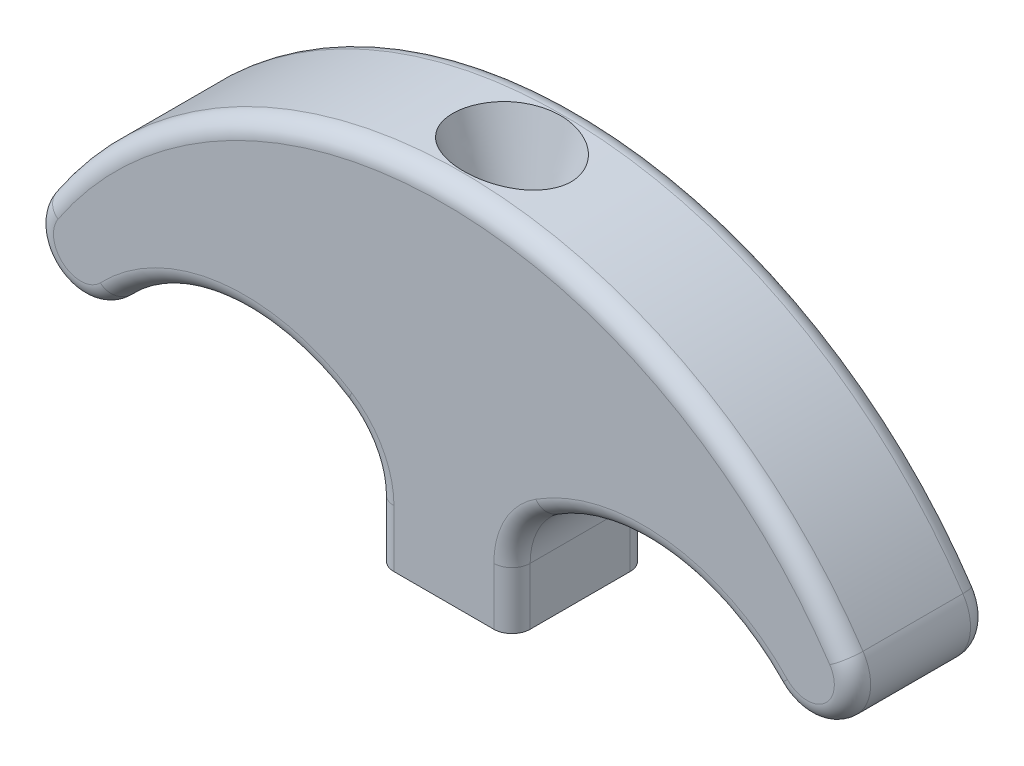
ISO-10303-21;
HEADER;
FILE_DESCRIPTION(('STEP AP214'),'2;1');
FILE_NAME('part.step','',(''),(''),'','','');
FILE_SCHEMA(('AUTOMOTIVE_DESIGN { 1 0 10303 214 1 1 1 1 }'));
ENDSEC;
DATA;
#1=APPLICATION_CONTEXT('core data for automotive mechanical design processes');
#2=APPLICATION_PROTOCOL_DEFINITION('international standard','automotive_design',2000,#1);
#3=PRODUCT_CONTEXT('',#1,'mechanical');
#4=PRODUCT('Part','Part','',(#3));
#5=PRODUCT_RELATED_PRODUCT_CATEGORY('part','',(#4));
#6=PRODUCT_DEFINITION_FORMATION('','',#4);
#7=PRODUCT_DEFINITION_CONTEXT('part definition',#1,'design');
#8=PRODUCT_DEFINITION('design','',#6,#7);
#9=PRODUCT_DEFINITION_SHAPE('','',#8);
#10=(LENGTH_UNIT() NAMED_UNIT(*) SI_UNIT(.MILLI.,.METRE.));
#11=(NAMED_UNIT(*) PLANE_ANGLE_UNIT() SI_UNIT($,.RADIAN.));
#12=(NAMED_UNIT(*) SI_UNIT($,.STERADIAN.) SOLID_ANGLE_UNIT());
#13=UNCERTAINTY_MEASURE_WITH_UNIT(LENGTH_MEASURE(1.E-05),#10,'distance_accuracy_value','');
#14=(GEOMETRIC_REPRESENTATION_CONTEXT(3) GLOBAL_UNCERTAINTY_ASSIGNED_CONTEXT((#13)) GLOBAL_UNIT_ASSIGNED_CONTEXT((#10,
#11,#12)) REPRESENTATION_CONTEXT('',''));
#15=CARTESIAN_POINT('',(0.,0.,0.));
#16=DIRECTION('',(0.,0.,1.));
#17=DIRECTION('',(1.,0.,0.));
#18=AXIS2_PLACEMENT_3D('',#15,#16,#17);
#19=CARTESIAN_POINT('',(4.7625,0.,9.525));
#20=DIRECTION('',(-1.,0.,0.));
#21=DIRECTION('',(0.,0.,1.));
#22=AXIS2_PLACEMENT_3D('',#19,#20,#21);
#23=PLANE('',#22);
#24=DIRECTION('',(0.,0.,1.));
#25=VECTOR('',#24,1.);
#26=CARTESIAN_POINT('',(4.7625,3.99382119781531,9.525));
#27=LINE('',#26,#25);
#28=CARTESIAN_POINT('',(4.7625,3.99382119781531,1.27));
#29=VERTEX_POINT('',#28);
#30=CARTESIAN_POINT('',(4.7625,3.99382119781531,8.255));
#31=VERTEX_POINT('',#30);
#32=EDGE_CURVE('E444',#29,#31,#27,.T.);
#33=ORIENTED_EDGE('',*,*,#32,.T.);
#34=DIRECTION('',(0.,1.,0.));
#35=VECTOR('',#34,1.);
#36=CARTESIAN_POINT('',(4.7625,0.,8.255));
#37=LINE('',#36,#35);
#38=CARTESIAN_POINT('',(4.7625,0.,8.255));
#39=VERTEX_POINT('',#38);
#40=EDGE_CURVE('E426',#31,#39,#37,.F.);
#41=ORIENTED_EDGE('',*,*,#40,.T.);
#42=DIRECTION('',(0.,0.,-1.));
#43=VECTOR('',#42,1.);
#44=CARTESIAN_POINT('',(4.7625,0.,9.525));
#45=LINE('',#44,#43);
#46=CARTESIAN_POINT('',(4.7625,0.,1.27));
#47=VERTEX_POINT('',#46);
#48=EDGE_CURVE('E199',#39,#47,#45,.T.);
#49=ORIENTED_EDGE('',*,*,#48,.T.);
#50=DIRECTION('',(0.,1.,0.));
#51=VECTOR('',#50,1.);
#52=CARTESIAN_POINT('',(4.7625,0.,1.27));
#53=LINE('',#52,#51);
#54=EDGE_CURVE('E423',#47,#29,#53,.T.);
#55=ORIENTED_EDGE('',*,*,#54,.T.);
#56=EDGE_LOOP('',(#33,#41,#49,#55));
#57=FACE_BOUND('',#56,.T.);
#58=ADVANCED_FACE('F36',(#57),#23,.F.);
#59=CARTESIAN_POINT('',(13.9347222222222,-2.43409582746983,9.525));
#60=DIRECTION('',(0.,0.,-1.));
#61=DIRECTION('',(-1.,0.,0.));
#62=AXIS2_PLACEMENT_3D('',#59,#60,#61);
#63=CYLINDRICAL_SURFACE('',#62,12.7);
#64=DIRECTION('',(0.,0.,-1.));
#65=VECTOR('',#64,1.);
#66=CARTESIAN_POINT('',(23.1069444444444,6.35,9.525));
#67=LINE('',#66,#65);
#68=CARTESIAN_POINT('',(23.1069444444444,6.35,8.255));
#69=VERTEX_POINT('',#68);
#70=CARTESIAN_POINT('',(23.1069444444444,6.35,1.27));
#71=VERTEX_POINT('',#70);
#72=EDGE_CURVE('E456',#69,#71,#67,.T.);
#73=ORIENTED_EDGE('',*,*,#72,.F.);
#74=CARTESIAN_POINT('',(13.9347222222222,-2.43409582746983,8.255));
#75=DIRECTION('',(0.,0.,1.));
#76=DIRECTION('',(1.,0.,0.));
#77=AXIS2_PLACEMENT_3D('',#74,#75,#76);
#78=CIRCLE('',#77,12.7);
#79=CARTESIAN_POINT('',(7.11435185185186,8.27909921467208,8.255));
#80=VERTEX_POINT('',#79);
#81=EDGE_CURVE('E218',#69,#80,#78,.T.);
#82=ORIENTED_EDGE('',*,*,#81,.T.);
#83=DIRECTION('',(0.,0.,-1.));
#84=VECTOR('',#83,1.);
#85=CARTESIAN_POINT('',(7.11435185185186,8.27909921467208,9.525));
#86=LINE('',#85,#84);
#87=CARTESIAN_POINT('',(7.11435185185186,8.27909921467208,1.27));
#88=VERTEX_POINT('',#87);
#89=EDGE_CURVE('E447',#80,#88,#86,.T.);
#90=ORIENTED_EDGE('',*,*,#89,.T.);
#91=CARTESIAN_POINT('',(13.9347222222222,-2.43409582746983,1.27));
#92=DIRECTION('',(0.,0.,1.));
#93=DIRECTION('',(1.,0.,0.));
#94=AXIS2_PLACEMENT_3D('',#91,#92,#93);
#95=CIRCLE('',#94,12.7);
#96=EDGE_CURVE('E216',#88,#71,#95,.F.);
#97=ORIENTED_EDGE('',*,*,#96,.T.);
#98=EDGE_LOOP('',(#73,#82,#90,#97));
#99=FACE_BOUND('',#98,.T.);
#100=ADVANCED_FACE('F331',(#99),#63,.F.);
#101=CARTESIAN_POINT('',(25.4,8.54602395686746,9.525));
#102=DIRECTION('',(0.,0.,-1.));
#103=DIRECTION('',(-1.,0.,0.));
#104=AXIS2_PLACEMENT_3D('',#101,#102,#103);
#105=CYLINDRICAL_SURFACE('',#104,3.175);
#106=DIRECTION('',(0.,0.,-1.));
#107=VECTOR('',#106,1.);
#108=CARTESIAN_POINT('',(28.0407166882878,10.3087605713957,9.525));
#109=LINE('',#108,#107);
#110=CARTESIAN_POINT('',(28.0407166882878,10.3087605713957,8.255));
#111=VERTEX_POINT('',#110);
#112=CARTESIAN_POINT('',(28.0407166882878,10.3087605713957,1.27));
#113=VERTEX_POINT('',#112);
#114=EDGE_CURVE('E459',#111,#113,#109,.T.);
#115=ORIENTED_EDGE('',*,*,#114,.F.);
#116=CARTESIAN_POINT('',(25.4,8.54602395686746,8.255));
#117=DIRECTION('',(0.,0.,1.));
#118=DIRECTION('',(1.,0.,0.));
#119=AXIS2_PLACEMENT_3D('',#116,#117,#118);
#120=CIRCLE('',#119,3.175);
#121=EDGE_CURVE('E222',#111,#69,#120,.F.);
#122=ORIENTED_EDGE('',*,*,#121,.T.);
#123=ORIENTED_EDGE('',*,*,#72,.T.);
#124=CARTESIAN_POINT('',(25.4,8.54602395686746,1.27));
#125=DIRECTION('',(0.,0.,1.));
#126=DIRECTION('',(1.,0.,0.));
#127=AXIS2_PLACEMENT_3D('',#124,#125,#126);
#128=CIRCLE('',#127,3.175);
#129=EDGE_CURVE('E220',#71,#113,#128,.T.);
#130=ORIENTED_EDGE('',*,*,#129,.T.);
#131=EDGE_LOOP('',(#115,#122,#123,#130));
#132=FACE_BOUND('',#131,.T.);
#133=ADVANCED_FACE('F327',(#132),#105,.T.);
#134=CARTESIAN_POINT('',(0.,-8.40903608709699,9.525));
#135=DIRECTION('',(0.,0.,-1.));
#136=DIRECTION('',(-1.,0.,0.));
#137=AXIS2_PLACEMENT_3D('',#134,#135,#136);
#138=CYLINDRICAL_SURFACE('',#137,33.714057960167);
#139=CARTESIAN_POINT('',(0.,25.30502187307,1.38096687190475));
#140=CARTESIAN_POINT('',(-0.0678517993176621,25.3050250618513,1.38094130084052));
#141=CARTESIAN_POINT('',(-0.135702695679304,25.3047971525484,1.38233297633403));
#142=CARTESIAN_POINT('',(-0.271165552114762,25.3039019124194,1.38791379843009));
#143=CARTESIAN_POINT('',(-0.338777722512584,25.3032353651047,1.39209795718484));
#144=CARTESIAN_POINT('',(-0.473617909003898,25.3014874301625,1.40321444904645));
#145=CARTESIAN_POINT('',(-0.540846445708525,25.3004069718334,1.41014062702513));
#146=CARTESIAN_POINT('',(-0.674775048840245,25.297855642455,1.42669324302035));
#147=CARTESIAN_POINT('',(-0.741476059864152,25.2963858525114,1.43631220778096));
#148=CARTESIAN_POINT('',(-0.874204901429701,25.2930803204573,1.45820231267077));
#149=CARTESIAN_POINT('',(-0.940234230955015,25.2912458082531,1.47046455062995));
#150=CARTESIAN_POINT('',(-1.07147493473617,25.2872352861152,1.49759331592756));
#151=CARTESIAN_POINT('',(-1.13668850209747,25.2850606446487,1.51244943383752));
#152=CARTESIAN_POINT('',(-1.26615274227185,25.2803943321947,1.54471813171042));
#153=CARTESIAN_POINT('',(-1.33040644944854,25.2779041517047,1.56211874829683));
#154=CARTESIAN_POINT('',(-1.45780588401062,25.2726312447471,1.59942867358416));
#155=CARTESIAN_POINT('',(-1.52095563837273,25.2698501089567,1.61932444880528));
#156=CARTESIAN_POINT('',(-1.64600192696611,25.2640197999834,1.66157694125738));
#157=CARTESIAN_POINT('',(-1.70790363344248,25.2609722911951,1.68391857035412));
#158=CARTESIAN_POINT('',(-1.83030843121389,25.254633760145,1.73101501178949));
#159=CARTESIAN_POINT('',(-1.89081799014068,25.2513444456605,1.75575323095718));
#160=CARTESIAN_POINT('',(-2.01029295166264,25.2445468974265,1.80759504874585));
#161=CARTESIAN_POINT('',(-2.06926625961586,25.2410403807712,1.83468063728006));
#162=CARTESIAN_POINT('',(-2.18552302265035,25.2338329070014,1.89116931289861));
#163=CARTESIAN_POINT('',(-2.24281594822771,25.2301336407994,1.92055310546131));
#164=CARTESIAN_POINT('',(-2.35556618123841,25.2225657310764,1.98159016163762));
#165=CARTESIAN_POINT('',(-2.41103462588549,25.2186987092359,2.01322303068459));
#166=CARTESIAN_POINT('',(-2.5199898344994,25.2108183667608,2.07871010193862));
#167=CARTESIAN_POINT('',(-2.57348946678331,25.2068065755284,2.11254305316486));
#168=CARTESIAN_POINT('',(-2.67836167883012,25.198667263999,2.18238164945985));
#169=CARTESIAN_POINT('',(-2.72974885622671,25.1945410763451,2.21836550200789));
#170=CARTESIAN_POINT('',(-2.83024805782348,25.1861761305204,2.29245790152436));
#171=CARTESIAN_POINT('',(-2.87937635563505,25.181938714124,2.33054449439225));
#172=CARTESIAN_POINT('',(-2.97517157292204,25.1734598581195,2.40875103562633));
#173=CARTESIAN_POINT('',(-3.02185813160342,25.169218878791,2.44884695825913));
#174=CARTESIAN_POINT('',(-3.11265745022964,25.1608435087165,2.53091175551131));
#175=CARTESIAN_POINT('',(-3.15679240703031,25.1567084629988,2.57285599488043));
#176=CARTESIAN_POINT('',(-3.24242330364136,25.1485492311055,2.65849840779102));
#177=CARTESIAN_POINT('',(-3.28394186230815,25.1445243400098,2.70217388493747));
#178=CARTESIAN_POINT('',(-3.36427753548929,25.1366164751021,2.79115901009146));
#179=CARTESIAN_POINT('',(-3.40311758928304,25.1327324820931,2.83644784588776));
#180=CARTESIAN_POINT('',(-3.47803317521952,25.1251303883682,2.92854021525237));
#181=CARTESIAN_POINT('',(-3.51413187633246,25.121411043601,2.97532478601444));
#182=CARTESIAN_POINT('',(-3.58350196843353,25.1141640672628,3.07028913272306));
#183=CARTESIAN_POINT('',(-3.61679662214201,25.1106349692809,3.11845179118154));
#184=CARTESIAN_POINT('',(-3.68049591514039,25.1037937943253,3.21605283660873));
#185=CARTESIAN_POINT('',(-3.71092372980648,25.1004800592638,3.26547596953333));
#186=CARTESIAN_POINT('',(-3.7688268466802,25.0940950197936,3.36547850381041));
#187=CARTESIAN_POINT('',(-3.79632499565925,25.091021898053,3.41604454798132));
#188=CARTESIAN_POINT('',(-3.84830650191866,25.0851434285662,3.518213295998));
#189=CARTESIAN_POINT('',(-3.87281206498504,25.0823361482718,3.56980457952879));
#190=CARTESIAN_POINT('',(-3.91874653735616,25.0770146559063,3.67390461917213));
#191=CARTESIAN_POINT('',(-3.94019661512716,25.0744984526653,3.72640391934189));
#192=CARTESIAN_POINT('',(-3.97995831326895,25.0697843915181,3.83219911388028));
#193=CARTESIAN_POINT('',(-3.99828957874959,25.0675845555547,3.88548753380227));
#194=CARTESIAN_POINT('',(-4.03175363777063,25.0635282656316,3.99274626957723));
#195=CARTESIAN_POINT('',(-4.04690395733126,25.0616699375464,4.04671101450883));
#196=CARTESIAN_POINT('',(-4.06720566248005,25.0591562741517,4.12815956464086));
#197=CARTESIAN_POINT('',(-4.07355987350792,25.058365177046,4.15534438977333));
#198=CARTESIAN_POINT('',(-4.0854481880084,25.0568779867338,4.20983877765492));
#199=CARTESIAN_POINT('',(-4.09098392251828,25.0561817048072,4.23714797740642));
#200=CARTESIAN_POINT('',(-4.10122730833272,25.0548873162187,4.29187522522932));
#201=CARTESIAN_POINT('',(-4.10593635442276,25.0542890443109,4.3192930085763));
#202=CARTESIAN_POINT('',(-4.11451886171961,25.0531937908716,4.37422290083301));
#203=CARTESIAN_POINT('',(-4.11839345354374,25.0526966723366,4.40173483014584));
#204=CARTESIAN_POINT('',(-4.12529945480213,25.0518068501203,4.45683813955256));
#205=CARTESIAN_POINT('',(-4.12833170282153,25.0514140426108,4.48442941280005));
#206=CARTESIAN_POINT('',(-4.13354549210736,25.0507359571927,4.53967664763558));
#207=CARTESIAN_POINT('',(-4.13572755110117,25.0504506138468,4.56733255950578));
#208=CARTESIAN_POINT('',(-4.13923340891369,25.049990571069,4.62269429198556));
#209=CARTESIAN_POINT('',(-4.14055737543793,25.0498158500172,4.65040010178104));
#210=CARTESIAN_POINT('',(-4.14233970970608,25.049580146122,4.70584690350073));
#211=CARTESIAN_POINT('',(-4.14279786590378,25.0495191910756,4.73358790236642));
#212=CARTESIAN_POINT('',(-4.14284056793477,25.0495141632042,4.78906930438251));
#213=CARTESIAN_POINT('',(-4.14242515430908,25.0495700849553,4.8168097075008));
#214=CARTESIAN_POINT('',(-4.14072714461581,25.0497958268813,4.87225415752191));
#215=CARTESIAN_POINT('',(-4.1394448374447,25.0499656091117,4.89995821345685));
#216=CARTESIAN_POINT('',(-4.1360214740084,25.0504158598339,4.95531536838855));
#217=CARTESIAN_POINT('',(-4.13388032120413,25.050696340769,4.98296846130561));
#218=CARTESIAN_POINT('',(-4.12874748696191,25.0513647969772,5.03820907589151));
#219=CARTESIAN_POINT('',(-4.12575535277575,25.0517528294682,5.06579655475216));
#220=CARTESIAN_POINT('',(-4.11892878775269,25.0526331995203,5.1208913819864));
#221=CARTESIAN_POINT('',(-4.11509357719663,25.0531256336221,5.14839863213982));
#222=CARTESIAN_POINT('',(-4.10658908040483,25.0542116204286,5.20331836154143));
#223=CARTESIAN_POINT('',(-4.1019187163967,25.0548053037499,5.23073067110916));
#224=CARTESIAN_POINT('',(-4.09175198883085,25.0560906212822,5.28544625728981));
#225=CARTESIAN_POINT('',(-4.08625427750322,25.05678241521,5.31274927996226));
#226=CARTESIAN_POINT('',(-4.07444134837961,25.0582607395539,5.36723068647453));
#227=CARTESIAN_POINT('',(-4.06812454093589,25.0590474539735,5.3944087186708));
#228=CARTESIAN_POINT('',(-4.04793470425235,25.0615480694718,5.475834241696));
#229=CARTESIAN_POINT('',(-4.03285751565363,25.0633979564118,5.52978401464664));
#230=CARTESIAN_POINT('',(-3.99953745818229,25.0674378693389,5.63701132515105));
#231=CARTESIAN_POINT('',(-3.98127727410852,25.06962974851,5.69028338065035));
#232=CARTESIAN_POINT('',(-3.94165587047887,25.0743284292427,5.79604510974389));
#233=CARTESIAN_POINT('',(-3.92027514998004,25.0768371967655,5.84852738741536));
#234=CARTESIAN_POINT('',(-3.8744778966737,25.0821443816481,5.95259338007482));
#235=CARTESIAN_POINT('',(-3.8500402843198,25.0849447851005,6.00416770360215));
#236=CARTESIAN_POINT('',(-3.79819354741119,25.0908100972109,6.10630327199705));
#237=CARTESIAN_POINT('',(-3.77076226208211,25.0938769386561,6.1568531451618));
#238=CARTESIAN_POINT('',(-3.71299209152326,25.1002500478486,6.25682481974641));
#239=CARTESIAN_POINT('',(-3.68263037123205,25.1035581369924,6.30623329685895));
#240=CARTESIAN_POINT('',(-3.61906282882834,25.110388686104,6.40380725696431));
#241=CARTESIAN_POINT('',(-3.58583381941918,25.1139128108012,6.45195750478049));
#242=CARTESIAN_POINT('',(-3.51659490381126,25.1211505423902,6.54689998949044));
#243=CARTESIAN_POINT('',(-3.48056170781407,25.124865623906,6.59367511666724));
#244=CARTESIAN_POINT('',(-3.40577736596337,25.1324599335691,6.68575232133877));
#245=CARTESIAN_POINT('',(-3.36700301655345,25.1363404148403,6.73103543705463));
#246=CARTESIAN_POINT('',(-3.28679921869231,25.144242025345,6.82001347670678));
#247=CARTESIAN_POINT('',(-3.24534679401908,25.1482641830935,6.86368758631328));
#248=CARTESIAN_POINT('',(-3.15984926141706,25.1564187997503,6.94933272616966));
#249=CARTESIAN_POINT('',(-3.11578150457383,25.160551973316,6.99128106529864));
#250=CARTESIAN_POINT('',(-3.02511678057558,25.1689243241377,7.07335880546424));
#251=CARTESIAN_POINT('',(-2.97849758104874,25.1731641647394,7.11346357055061));
#252=CARTESIAN_POINT('',(-2.88284281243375,25.1816420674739,7.19169810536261));
#253=CARTESIAN_POINT('',(-2.83378765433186,25.1858796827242,7.2298039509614));
#254=CARTESIAN_POINT('',(-2.73344259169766,25.1942467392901,7.30394838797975));
#255=CARTESIAN_POINT('',(-2.68213650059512,25.198374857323,7.33996519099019));
#256=CARTESIAN_POINT('',(-2.57743022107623,25.2065193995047,7.40988013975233));
#257=CARTESIAN_POINT('',(-2.52401547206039,25.2105345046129,7.44375660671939));
#258=CARTESIAN_POINT('',(-2.41523120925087,25.2184227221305,7.50934001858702));
#259=CARTESIAN_POINT('',(-2.35984882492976,25.2222943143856,7.54102577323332));
#260=CARTESIAN_POINT('',(-2.24726890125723,25.2298724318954,7.60217626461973));
#261=CARTESIAN_POINT('',(-2.19006018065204,25.2335773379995,7.63162059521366));
#262=CARTESIAN_POINT('',(-2.07396713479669,25.2407969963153,7.68823652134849));
#263=CARTESIAN_POINT('',(-2.0150732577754,25.2443100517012,7.7153887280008));
#264=CARTESIAN_POINT('',(-1.89574954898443,25.2511214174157,7.76736843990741));
#265=CARTESIAN_POINT('',(-1.8353116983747,25.2544179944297,7.79217774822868));
#266=CARTESIAN_POINT('',(-1.71303979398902,25.2607716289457,7.83941952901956));
#267=CARTESIAN_POINT('',(-1.65119913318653,25.263826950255,7.86183512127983));
#268=CARTESIAN_POINT('',(-1.52626148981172,25.2696733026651,7.90423720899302));
#269=CARTESIAN_POINT('',(-1.46315917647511,25.2724626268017,7.92420822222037));
#270=CARTESIAN_POINT('',(-1.33583824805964,25.277752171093,7.96166880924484));
#271=CARTESIAN_POINT('',(-1.27161543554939,25.2802507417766,7.9791443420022));
#272=CARTESIAN_POINT('',(-1.14219367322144,25.2849339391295,8.01156157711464));
#273=CARTESIAN_POINT('',(-1.07699151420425,25.2871169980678,8.02649068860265));
#274=CARTESIAN_POINT('',(-0.94575136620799,25.2911443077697,8.05376268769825));
#275=CARTESIAN_POINT('',(-0.879711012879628,25.2929870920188,8.06609441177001));
#276=CARTESIAN_POINT('',(-0.746934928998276,25.2963089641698,8.08811922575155));
#277=CARTESIAN_POINT('',(-0.680197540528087,25.2977867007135,8.09780252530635));
#278=CARTESIAN_POINT('',(-0.546167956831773,25.3003535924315,8.11447826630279));
#279=CARTESIAN_POINT('',(-0.478874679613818,25.3014415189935,8.12146220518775));
#280=CARTESIAN_POINT('',(-0.343874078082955,25.3032038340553,8.13268657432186));
#281=CARTESIAN_POINT('',(-0.2761661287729,25.3038771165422,8.1369196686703));
#282=CARTESIAN_POINT('',(-0.140476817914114,25.3047854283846,8.14259172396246));
#283=CARTESIAN_POINT('',(-0.0724951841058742,25.3050194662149,8.1440243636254));
#284=CARTESIAN_POINT('',(0.063498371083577,25.3050236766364,8.14403788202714));
#285=CARTESIAN_POINT('',(0.131510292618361,25.3047936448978,8.14261750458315));
#286=CARTESIAN_POINT('',(0.267315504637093,25.3038924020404,8.13696243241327));
#287=CARTESIAN_POINT('',(0.335108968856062,25.3032218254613,8.1327317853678));
#288=CARTESIAN_POINT('',(0.470328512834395,25.3014644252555,8.12150895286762));
#289=CARTESIAN_POINT('',(0.537755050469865,25.3003784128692,8.11452214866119));
#290=CARTESIAN_POINT('',(0.672091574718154,25.2978148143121,8.09783764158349));
#291=CARTESIAN_POINT('',(0.739002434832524,25.2963382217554,8.08814681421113));
#292=CARTESIAN_POINT('',(0.872158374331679,25.2930181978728,8.06610526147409));
#293=CARTESIAN_POINT('',(0.938404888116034,25.2911759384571,8.05376302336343));
#294=CARTESIAN_POINT('',(1.07008273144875,25.2871493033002,8.02646939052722));
#295=CARTESIAN_POINT('',(1.13551621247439,25.2849662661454,8.0115281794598));
#296=CARTESIAN_POINT('',(1.26541843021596,25.2802828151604,7.97908729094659));
#297=CARTESIAN_POINT('',(1.32989019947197,25.2777838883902,7.96159954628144));
#298=CARTESIAN_POINT('',(1.45771926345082,25.2724934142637,7.92411621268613));
#299=CARTESIAN_POINT('',(1.52108064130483,25.269703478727,7.90413432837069));
#300=CARTESIAN_POINT('',(1.64653902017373,25.2638557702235,7.86171331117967));
#301=CARTESIAN_POINT('',(1.70864132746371,25.2607997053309,7.83928964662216));
#302=CARTESIAN_POINT('',(1.83143148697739,25.254444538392,7.7920356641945));
#303=CARTESIAN_POINT('',(1.89212604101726,25.2511472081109,7.76722253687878));
#304=CARTESIAN_POINT('',(2.01195044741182,25.2443343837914,7.71524026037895));
#305=CARTESIAN_POINT('',(2.0710885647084,25.2408206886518,7.68808994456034));
#306=CARTESIAN_POINT('',(2.18764966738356,25.2335998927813,7.63148398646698));
#307=CARTESIAN_POINT('',(2.24508263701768,25.2298945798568,7.60204869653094));
#308=CARTESIAN_POINT('',(2.35808292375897,25.2223159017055,7.54092363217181));
#309=CARTESIAN_POINT('',(2.41366207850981,25.2184442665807,7.50925555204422));
#310=CARTESIAN_POINT('',(2.52280385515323,25.2105562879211,7.44371581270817));
#311=CARTESIAN_POINT('',(2.57638026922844,25.2065415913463,7.40986695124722));
#312=CARTESIAN_POINT('',(2.68136644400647,25.198398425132,7.34001718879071));
#313=CARTESIAN_POINT('',(2.73279198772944,25.1942714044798,7.30403987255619));
#314=CARTESIAN_POINT('',(2.83332314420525,25.1859067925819,7.22998358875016));
#315=CARTESIAN_POINT('',(2.88244652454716,25.1816706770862,7.19192861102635));
#316=CARTESIAN_POINT('',(2.97820396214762,25.1731957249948,7.11379575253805));
#317=CARTESIAN_POINT('',(3.02485863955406,25.1689573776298,7.07374311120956));
#318=CARTESIAN_POINT('',(3.11558857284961,25.1605877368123,6.99176326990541));
#319=CARTESIAN_POINT('',(3.15968619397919,25.1564557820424,6.94986089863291));
#320=CARTESIAN_POINT('',(3.24523680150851,25.1483030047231,6.86430052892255));
#321=CARTESIAN_POINT('',(3.28671256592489,25.14428147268,6.82066538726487));
#322=CARTESIAN_POINT('',(3.36695743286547,25.1363806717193,6.73175963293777));
#323=CARTESIAN_POINT('',(3.40574961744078,25.1325003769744,6.68650995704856));
#324=CARTESIAN_POINT('',(3.48056454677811,25.1249060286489,6.59449487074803));
#325=CARTESIAN_POINT('',(3.51661058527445,25.1211907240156,6.54774851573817));
#326=CARTESIAN_POINT('',(3.58587076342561,25.1139521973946,6.452859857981));
#327=CARTESIAN_POINT('',(3.61910826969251,25.1104275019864,6.40473473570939));
#328=CARTESIAN_POINT('',(3.6826890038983,25.1035955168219,6.30720830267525));
#329=CARTESIAN_POINT('',(3.71305548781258,25.1002865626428,6.25782228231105));
#330=CARTESIAN_POINT('',(3.77083200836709,25.0939114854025,6.15789379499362));
#331=CARTESIAN_POINT('',(3.79826494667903,25.0908435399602,6.10736469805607));
#332=CARTESIAN_POINT('',(3.85011242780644,25.0849758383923,6.0052699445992));
#333=CARTESIAN_POINT('',(3.87454920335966,25.0821741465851,5.95371570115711));
#334=CARTESIAN_POINT('',(3.92034282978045,25.076864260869,5.8496901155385));
#335=CARTESIAN_POINT('',(3.94172084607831,25.0743540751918,5.79722820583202));
#336=CARTESIAN_POINT('',(3.98133548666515,25.0696524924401,5.69150843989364));
#337=CARTESIAN_POINT('',(3.99959172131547,25.0674591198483,5.63825802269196));
#338=CARTESIAN_POINT('',(4.03290311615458,25.0634162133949,5.53107619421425));
#339=CARTESIAN_POINT('',(4.04797573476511,25.0615648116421,5.47715031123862));
#340=CARTESIAN_POINT('',(4.06815887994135,25.0590619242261,5.3957617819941));
#341=CARTESIAN_POINT('',(4.07447337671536,25.0582744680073,5.36859684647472));
#342=CARTESIAN_POINT('',(4.08628172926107,25.0567946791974,5.31414255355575));
#343=CARTESIAN_POINT('',(4.09177720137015,25.0561021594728,5.2868535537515));
#344=CARTESIAN_POINT('',(4.10193957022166,25.0548154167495,5.23216705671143));
#345=CARTESIAN_POINT('',(4.10660784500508,25.054221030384,5.20476981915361));
#346=CARTESIAN_POINT('',(4.11510835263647,25.053133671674,5.14988139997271));
#347=CARTESIAN_POINT('',(4.11894169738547,25.0526405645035,5.12239039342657));
#348=CARTESIAN_POINT('',(4.12576480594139,25.0517588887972,5.06732934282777));
#349=CARTESIAN_POINT('',(4.12875538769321,25.0513702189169,5.03975940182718));
#350=CARTESIAN_POINT('',(4.13388541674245,25.0507005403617,4.98455527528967));
#351=CARTESIAN_POINT('',(4.13602535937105,25.0504194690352,4.95692113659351));
#352=CARTESIAN_POINT('',(4.13944685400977,25.0499680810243,4.90160342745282));
#353=CARTESIAN_POINT('',(4.14072854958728,25.049797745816,4.87391986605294));
#354=CARTESIAN_POINT('',(4.14242529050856,25.0495710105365,4.81851806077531));
#355=CARTESIAN_POINT('',(4.14284009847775,25.0495146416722,4.79079980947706));
#356=CARTESIAN_POINT('',(4.14279870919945,25.0495186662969,4.73536258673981));
#357=CARTESIAN_POINT('',(4.14234246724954,25.0495790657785,4.70764361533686));
#358=CARTESIAN_POINT('',(4.14056878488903,25.0498133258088,4.65223880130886));
#359=CARTESIAN_POINT('',(4.1392514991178,25.0499871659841,4.62455295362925));
#360=CARTESIAN_POINT('',(4.13576283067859,25.050445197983,4.5692291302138));
#361=CARTESIAN_POINT('',(4.13359123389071,25.0507294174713,4.54159116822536));
#362=CARTESIAN_POINT('',(4.12840205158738,25.0514050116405,4.48637786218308));
#363=CARTESIAN_POINT('',(4.12538391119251,25.0517964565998,4.45880257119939));
#364=CARTESIAN_POINT('',(4.11850943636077,25.052683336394,4.40372930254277));
#365=CARTESIAN_POINT('',(4.11465223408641,25.053178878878,4.37623143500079));
#366=CARTESIAN_POINT('',(4.10610750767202,25.0542707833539,4.32132778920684));
#367=CARTESIAN_POINT('',(4.10141883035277,25.0548672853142,4.29392219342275));
#368=CARTESIAN_POINT('',(4.09121886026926,25.0561579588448,4.23921749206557));
#369=CARTESIAN_POINT('',(4.08570615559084,25.0568522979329,4.21191865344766));
#370=CARTESIAN_POINT('',(4.07386625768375,25.0583354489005,4.15744320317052));
#371=CARTESIAN_POINT('',(4.06753742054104,25.0591244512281,4.13026695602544));
#372=CARTESIAN_POINT('',(4.04731482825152,25.0616316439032,4.04884088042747));
#373=CARTESIAN_POINT('',(4.0322213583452,25.0634853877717,3.9948881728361));
#374=CARTESIAN_POINT('',(3.99887663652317,25.067532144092,3.88764688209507));
#375=CARTESIAN_POINT('',(3.98060780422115,25.0697270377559,3.83436386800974));
#376=CARTESIAN_POINT('',(3.94097408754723,25.0744310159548,3.72857326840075));
#377=CARTESIAN_POINT('',(3.91958949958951,25.076942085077,3.67607315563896));
#378=CARTESIAN_POINT('',(3.87378661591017,25.0822532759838,3.57196564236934));
#379=CARTESIAN_POINT('',(3.84934706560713,25.0850553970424,3.52036770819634));
#380=CARTESIAN_POINT('',(3.79749571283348,25.0909236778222,3.41818017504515));
#381=CARTESIAN_POINT('',(3.77006157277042,25.0939917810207,3.36760203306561));
#382=CARTESIAN_POINT('',(3.71228213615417,25.1003670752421,3.2675701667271));
#383=CARTESIAN_POINT('',(3.68191380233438,25.1036760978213,3.21812987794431));
#384=CARTESIAN_POINT('',(3.61832668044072,25.110508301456,3.12048971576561));
#385=CARTESIAN_POINT('',(3.58508445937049,25.114033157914,3.07230523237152));
#386=CARTESIAN_POINT('',(3.51580999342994,25.1212722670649,2.97729274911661));
#387=CARTESIAN_POINT('',(3.47975415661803,25.1249880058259,2.93048207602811));
#388=CARTESIAN_POINT('',(3.40491262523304,25.1325836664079,2.83833330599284));
#389=CARTESIAN_POINT('',(3.36610335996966,25.1364648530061,2.79301446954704));
#390=CARTESIAN_POINT('',(3.28581511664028,25.1443680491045,2.7039654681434));
#391=CARTESIAN_POINT('',(3.24431272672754,25.1483910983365,2.66025651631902));
#392=CARTESIAN_POINT('',(3.15869768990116,25.1565477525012,2.5745434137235));
#393=CARTESIAN_POINT('',(3.1145618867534,25.1606820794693,2.53256247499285));
#394=CARTESIAN_POINT('',(3.02374151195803,25.1690573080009,2.45042131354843));
#395=CARTESIAN_POINT('',(2.97703414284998,25.1732988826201,2.41028637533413));
#396=CARTESIAN_POINT('',(2.88118389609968,25.1817796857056,2.33200266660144));
#397=CARTESIAN_POINT('',(2.83202103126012,25.1860184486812,2.29387833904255));
#398=CARTESIAN_POINT('',(2.73144757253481,25.1943862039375,2.21971428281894));
#399=CARTESIAN_POINT('',(2.68002063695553,25.198513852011,2.18369659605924));
#400=CARTESIAN_POINT('',(2.57506441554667,25.2066562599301,2.11379395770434));
#401=CARTESIAN_POINT('',(2.52152047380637,25.2106696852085,2.079930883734));
#402=CARTESIAN_POINT('',(2.41247332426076,25.2185534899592,2.01438633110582));
#403=CARTESIAN_POINT('',(2.3569572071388,25.2224223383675,1.98272617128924));
#404=CARTESIAN_POINT('',(2.24410932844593,25.229994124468,1.92163662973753));
#405=CARTESIAN_POINT('',(2.18676640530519,25.2336954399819,1.89222768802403));
#406=CARTESIAN_POINT('',(2.07040840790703,25.2409072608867,1.83569009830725));
#407=CARTESIAN_POINT('',(2.01138385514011,25.2444160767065,1.80858076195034));
#408=CARTESIAN_POINT('',(1.89180621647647,25.2512184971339,1.75669213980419));
#409=CARTESIAN_POINT('',(1.83124523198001,25.2545103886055,1.73193084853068));
#410=CARTESIAN_POINT('',(1.70873845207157,25.2608543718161,1.68478826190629));
#411=CARTESIAN_POINT('',(1.64678620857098,25.2639047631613,1.66242350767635));
#412=CARTESIAN_POINT('',(1.52164077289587,25.2697411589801,1.62012407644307));
#413=CARTESIAN_POINT('',(1.45844243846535,25.2725255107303,1.60020439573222));
#414=CARTESIAN_POINT('',(1.33094883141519,25.2778051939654,1.56284528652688));
#415=CARTESIAN_POINT('',(1.26664956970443,25.2802989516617,1.54541925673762));
#416=CARTESIAN_POINT('',(1.13709827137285,25.2849727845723,1.5130976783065));
#417=CARTESIAN_POINT('',(1.07184324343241,25.2871513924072,1.49821391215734));
#418=CARTESIAN_POINT('',(0.940524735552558,25.2911702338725,1.47102711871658));
#419=CARTESIAN_POINT('',(0.874459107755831,25.2930091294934,1.4587342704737));
#420=CARTESIAN_POINT('',(0.741663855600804,25.2963238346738,1.43677953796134));
#421=CARTESIAN_POINT('',(0.67493277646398,25.2977984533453,1.42712627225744));
#422=CARTESIAN_POINT('',(0.540951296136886,25.3003598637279,1.41050098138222));
#423=CARTESIAN_POINT('',(0.473699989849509,25.3014456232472,1.40353608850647));
#424=CARTESIAN_POINT('',(0.338822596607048,25.3032046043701,1.39233741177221));
#425=CARTESIAN_POINT('',(0.271196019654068,25.3038769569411,1.38810938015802));
#426=CARTESIAN_POINT('',(0.135713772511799,25.3047842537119,1.38243545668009));
#427=CARTESIAN_POINT('',(0.0678579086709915,25.3050184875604,1.38099408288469));
#428=CARTESIAN_POINT('',(0.,25.30502187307,1.38096687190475));
#429=B_SPLINE_CURVE_WITH_KNOTS('',3,(#139,#140,#141,#142,#143,#144,#145,#146,#147,#148,#149,
#150,#151,#152,#153,#154,#155,#156,#157,#158,#159,#160,#161,#162,#163,#164,#165,#166,#167,#168,
#169,#170,#171,#172,#173,#174,#175,#176,#177,#178,#179,#180,#181,#182,#183,#184,#185,#186,#187,
#188,#189,#190,#191,#192,#193,#194,#195,#196,#197,#198,#199,#200,#201,#202,#203,#204,#205,#206,
#207,#208,#209,#210,#211,#212,#213,#214,#215,#216,#217,#218,#219,#220,#221,#222,#223,#224,#225,
#226,#227,#228,#229,#230,#231,#232,#233,#234,#235,#236,#237,#238,#239,#240,#241,#242,#243,#244,
#245,#246,#247,#248,#249,#250,#251,#252,#253,#254,#255,#256,#257,#258,#259,#260,#261,#262,#263,
#264,#265,#266,#267,#268,#269,#270,#271,#272,#273,#274,#275,#276,#277,#278,#279,#280,#281,#282,
#283,#284,#285,#286,#287,#288,#289,#290,#291,#292,#293,#294,#295,#296,#297,#298,#299,#300,#301,
#302,#303,#304,#305,#306,#307,#308,#309,#310,#311,#312,#313,#314,#315,#316,#317,#318,#319,#320,
#321,#322,#323,#324,#325,#326,#327,#328,#329,#330,#331,#332,#333,#334,#335,#336,#337,#338,#339,
#340,#341,#342,#343,#344,#345,#346,#347,#348,#349,#350,#351,#352,#353,#354,#355,#356,#357,#358,
#359,#360,#361,#362,#363,#364,#365,#366,#367,#368,#369,#370,#371,#372,#373,#374,#375,#376,#377,
#378,#379,#380,#381,#382,#383,#384,#385,#386,#387,#388,#389,#390,#391,#392,#393,#394,#395,#396,
#397,#398,#399,#400,#401,#402,#403,#404,#405,#406,#407,#408,#409,#410,#411,#412,#413,#414,#415,
#416,#417,#418,#419,#420,#421,#422,#423,#424,#425,#426,#427,#428),.UNSPECIFIED.,.F.,.F.,(4,2,2,
2,2,2,2,2,2,2,2,2,2,2,2,2,2,2,2,2,2,2,2,2,2,2,2,2,2,2,2,2,2,2,2,2,2,2,2,2,2,2,2,2,2,2,2,2,2,2,2,
2,2,2,2,2,2,2,2,2,2,2,2,2,2,2,2,2,2,2,2,2,2,2,2,2,2,2,2,2,2,2,2,2,2,2,2,2,2,2,2,2,2,2,2,2,2,2,2,
2,2,2,2,2,2,2,2,2,2,2,2,2,2,2,2,2,2,2,2,2,2,2,2,2,2,2,2,2,2,2,2,2,2,2,2,2,2,2,2,2,2,2,2,2,4),
(0.,0.203538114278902,0.406713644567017,0.609435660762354,0.811600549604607,1.01309492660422,
1.21379853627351,1.413587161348,1.61233556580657,1.80992049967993,2.00622379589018,
2.20113559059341,2.3945576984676,2.58640717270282,2.77662007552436,2.96515547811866,
3.1519996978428,3.33698326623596,3.51998723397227,3.70109362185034,3.88038151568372,
4.05792964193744,4.23381907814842,4.40813608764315,4.58097506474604,4.75244157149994,
4.9226554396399,5.09175390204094,5.25989470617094,5.34367085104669,5.42727773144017,
5.51074216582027,5.59409279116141,5.67736013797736,5.76057669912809,5.84377699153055,
5.92699760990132,6.01021436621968,6.09340340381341,6.17660179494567,6.25984453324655,
6.34316458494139,6.42659294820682,6.51015871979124,6.59388916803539,6.76192651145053,
6.93090824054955,7.10099518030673,7.27232734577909,7.44502702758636,7.61920190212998,
7.79494811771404,7.97235331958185,8.15149958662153,8.33246626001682,8.51533264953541,
8.70018060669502,8.88688793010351,9.07528216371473,9.26535104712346,9.45705637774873,
9.65033811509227,9.84511825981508,10.041304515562,10.2387937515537,10.4374752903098,
10.6372340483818,10.837953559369,11.0395189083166,11.2418196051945,11.4447524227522,
11.6482242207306,11.8521547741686,12.0561751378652,12.2599022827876,12.4632336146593,
12.6660525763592,12.8682317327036,13.0696358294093,13.270124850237,13.4695571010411,
13.6677923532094,13.8646950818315,14.0601378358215,14.2540047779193,14.4461954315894,
14.6366286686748,14.8252469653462,15.0120209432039,15.1968468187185,15.3796825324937,
15.5606121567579,15.7397167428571,15.9170768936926,16.0927754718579,16.2669004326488,
16.4395477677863,16.6108245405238,16.7808519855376,16.9497686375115,17.1177334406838,
17.2014241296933,17.2849474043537,17.3683302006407,17.4516012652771,17.5347912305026,
17.6179326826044,17.7010602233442,17.7842105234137,17.8673650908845,17.9505047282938,
18.0336652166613,18.1168803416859,18.2001819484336,18.2836000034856,18.36716266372,
18.4508963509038,18.6189564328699,18.7879784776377,18.9581199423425,19.1295189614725,
19.3022973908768,19.4765638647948,19.6524168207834,19.8299474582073,20.0092426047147,
20.1903874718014,20.3734682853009,20.5585747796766,20.7455699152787,20.9342609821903,
21.1246343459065,21.316648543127,21.5102385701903,21.7053199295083,21.9017924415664,
22.0995438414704,22.298453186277,22.4983941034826,22.6992379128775,22.9008566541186,
23.1031260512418,23.3059284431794,23.5091557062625,23.7127121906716),.UNSPECIFIED.);
#430=CARTESIAN_POINT('',(0.,25.30502187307,1.38096687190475));
#431=VERTEX_POINT('',#430);
#432=EDGE_CURVE('E49',#431,#431,#429,.F.);
#433=ORIENTED_EDGE('',*,*,#432,.T.);
#434=EDGE_LOOP('',(#433));
#435=FACE_BOUND('',#434,.T.);
#436=ORIENTED_EDGE('',*,*,#114,.T.);
#437=CARTESIAN_POINT('',(0.,-8.40903608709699,1.27));
#438=DIRECTION('',(0.,0.,1.));
#439=DIRECTION('',(1.,0.,0.));
#440=AXIS2_PLACEMENT_3D('',#437,#438,#439);
#441=CIRCLE('',#440,33.714057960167);
#442=CARTESIAN_POINT('',(-28.0407166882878,10.3087605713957,1.27));
#443=VERTEX_POINT('',#442);
#444=EDGE_CURVE('E258',#113,#443,#441,.T.);
#445=ORIENTED_EDGE('',*,*,#444,.T.);
#446=DIRECTION('',(0.,0.,-1.));
#447=VECTOR('',#446,1.);
#448=CARTESIAN_POINT('',(-28.0407166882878,10.3087605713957,9.525));
#449=LINE('',#448,#447);
#450=CARTESIAN_POINT('',(-28.0407166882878,10.3087605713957,8.255));
#451=VERTEX_POINT('',#450);
#452=EDGE_CURVE('E462',#451,#443,#449,.T.);
#453=ORIENTED_EDGE('',*,*,#452,.F.);
#454=CARTESIAN_POINT('',(0.,-8.40903608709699,8.255));
#455=DIRECTION('',(0.,0.,1.));
#456=DIRECTION('',(1.,0.,0.));
#457=AXIS2_PLACEMENT_3D('',#454,#455,#456);
#458=CIRCLE('',#457,33.714057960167);
#459=EDGE_CURVE('E256',#451,#111,#458,.F.);
#460=ORIENTED_EDGE('',*,*,#459,.T.);
#461=EDGE_LOOP('',(#436,#445,#453,#460));
#462=FACE_BOUND('',#461,.T.);
#463=ADVANCED_FACE('F316',(#435,#462),#138,.T.);
#464=CARTESIAN_POINT('',(-25.4,8.54602395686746,9.525));
#465=DIRECTION('',(0.,0.,-1.));
#466=DIRECTION('',(-1.,0.,0.));
#467=AXIS2_PLACEMENT_3D('',#464,#465,#466);
#468=CYLINDRICAL_SURFACE('',#467,3.175);
#469=DIRECTION('',(0.,0.,-1.));
#470=VECTOR('',#469,1.);
#471=CARTESIAN_POINT('',(-23.1069444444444,6.35,9.525));
#472=LINE('',#471,#470);
#473=CARTESIAN_POINT('',(-23.1069444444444,6.35,8.255));
#474=VERTEX_POINT('',#473);
#475=CARTESIAN_POINT('',(-23.1069444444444,6.35,1.27));
#476=VERTEX_POINT('',#475);
#477=EDGE_CURVE('E465',#474,#476,#472,.T.);
#478=ORIENTED_EDGE('',*,*,#477,.F.);
#479=CARTESIAN_POINT('',(-25.4,8.54602395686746,8.255));
#480=DIRECTION('',(0.,0.,1.));
#481=DIRECTION('',(1.,0.,0.));
#482=AXIS2_PLACEMENT_3D('',#479,#480,#481);
#483=CIRCLE('',#482,3.175);
#484=EDGE_CURVE('E238',#474,#451,#483,.F.);
#485=ORIENTED_EDGE('',*,*,#484,.T.);
#486=ORIENTED_EDGE('',*,*,#452,.T.);
#487=CARTESIAN_POINT('',(-25.4,8.54602395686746,1.27));
#488=DIRECTION('',(0.,0.,1.));
#489=DIRECTION('',(1.,0.,0.));
#490=AXIS2_PLACEMENT_3D('',#487,#488,#489);
#491=CIRCLE('',#490,3.175);
#492=EDGE_CURVE('E236',#443,#476,#491,.T.);
#493=ORIENTED_EDGE('',*,*,#492,.T.);
#494=EDGE_LOOP('',(#478,#485,#486,#493));
#495=FACE_BOUND('',#494,.T.);
#496=ADVANCED_FACE('F326',(#495),#468,.T.);
#497=CARTESIAN_POINT('',(-13.9347222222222,-2.43409582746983,9.525));
#498=DIRECTION('',(0.,0.,-1.));
#499=DIRECTION('',(-1.,0.,0.));
#500=AXIS2_PLACEMENT_3D('',#497,#498,#499);
#501=CYLINDRICAL_SURFACE('',#500,12.7);
#502=DIRECTION('',(0.,0.,-1.));
#503=VECTOR('',#502,1.);
#504=CARTESIAN_POINT('',(-7.11435185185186,8.27909921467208,9.525));
#505=LINE('',#504,#503);
#506=CARTESIAN_POINT('',(-7.11435185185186,8.27909921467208,1.27));
#507=VERTEX_POINT('',#506);
#508=CARTESIAN_POINT('',(-7.11435185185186,8.27909921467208,8.255));
#509=VERTEX_POINT('',#508);
#510=EDGE_CURVE('E450',#507,#509,#505,.F.);
#511=ORIENTED_EDGE('',*,*,#510,.T.);
#512=CARTESIAN_POINT('',(-13.9347222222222,-2.43409582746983,8.255));
#513=DIRECTION('',(0.,0.,1.));
#514=DIRECTION('',(1.,0.,0.));
#515=AXIS2_PLACEMENT_3D('',#512,#513,#514);
#516=CIRCLE('',#515,12.7);
#517=EDGE_CURVE('E234',#509,#474,#516,.T.);
#518=ORIENTED_EDGE('',*,*,#517,.T.);
#519=ORIENTED_EDGE('',*,*,#477,.T.);
#520=CARTESIAN_POINT('',(-13.9347222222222,-2.43409582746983,1.27));
#521=DIRECTION('',(0.,0.,1.));
#522=DIRECTION('',(1.,0.,0.));
#523=AXIS2_PLACEMENT_3D('',#520,#521,#522);
#524=CIRCLE('',#523,12.7);
#525=EDGE_CURVE('E232',#476,#507,#524,.F.);
#526=ORIENTED_EDGE('',*,*,#525,.T.);
#527=EDGE_LOOP('',(#511,#518,#519,#526));
#528=FACE_BOUND('',#527,.T.);
#529=ADVANCED_FACE('F484',(#528),#501,.F.);
#530=CARTESIAN_POINT('',(-4.7625,0.,9.525));
#531=DIRECTION('',(1.,0.,0.));
#532=DIRECTION('',(0.,0.,-1.));
#533=AXIS2_PLACEMENT_3D('',#530,#531,#532);
#534=PLANE('',#533);
#535=DIRECTION('',(0.,0.,-1.));
#536=VECTOR('',#535,1.);
#537=CARTESIAN_POINT('',(-4.7625,0.,9.525));
#538=LINE('',#537,#536);
#539=CARTESIAN_POINT('',(-4.7625,0.,8.255));
#540=VERTEX_POINT('',#539);
#541=CARTESIAN_POINT('',(-4.7625,0.,1.27));
#542=VERTEX_POINT('',#541);
#543=EDGE_CURVE('E468',#540,#542,#538,.T.);
#544=ORIENTED_EDGE('',*,*,#543,.F.);
#545=DIRECTION('',(0.,-1.,0.));
#546=VECTOR('',#545,1.);
#547=CARTESIAN_POINT('',(-4.7625,3.99382119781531,8.255));
#548=LINE('',#547,#546);
#549=CARTESIAN_POINT('',(-4.7625,3.99382119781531,8.255));
#550=VERTEX_POINT('',#549);
#551=EDGE_CURVE('E204',#540,#550,#548,.F.);
#552=ORIENTED_EDGE('',*,*,#551,.T.);
#553=DIRECTION('',(0.,0.,1.));
#554=VECTOR('',#553,1.);
#555=CARTESIAN_POINT('',(-4.7625,3.99382119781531,0.));
#556=LINE('',#555,#554);
#557=CARTESIAN_POINT('',(-4.7625,3.99382119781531,1.27));
#558=VERTEX_POINT('',#557);
#559=EDGE_CURVE('E453',#550,#558,#556,.F.);
#560=ORIENTED_EDGE('',*,*,#559,.T.);
#561=DIRECTION('',(0.,-1.,0.));
#562=VECTOR('',#561,1.);
#563=CARTESIAN_POINT('',(-4.7625,0.,1.27));
#564=LINE('',#563,#562);
#565=EDGE_CURVE('E224',#558,#542,#564,.T.);
#566=ORIENTED_EDGE('',*,*,#565,.T.);
#567=EDGE_LOOP('',(#544,#552,#560,#566));
#568=FACE_BOUND('',#567,.T.);
#569=ADVANCED_FACE('F477',(#568),#534,.F.);
#570=CARTESIAN_POINT('',(-4.7625,0.,9.525));
#571=DIRECTION('',(0.,1.,0.));
#572=DIRECTION('',(0.,0.,1.));
#573=AXIS2_PLACEMENT_3D('',#570,#571,#572);
#574=PLANE('',#573);
#575=CARTESIAN_POINT('',(0.,0.,4.7625));
#576=DIRECTION('',(0.,-1.,0.));
#577=DIRECTION('',(0.,0.,-1.));
#578=AXIS2_PLACEMENT_3D('',#575,#576,#577);
#579=CIRCLE('',#578,1.905);
#580=CARTESIAN_POINT('',(0.,0.,2.8575));
#581=VERTEX_POINT('',#580);
#582=EDGE_CURVE('E283',#581,#581,#579,.T.);
#583=ORIENTED_EDGE('',*,*,#582,.F.);
#584=EDGE_LOOP('',(#583));
#585=FACE_BOUND('',#584,.T.);
#586=ORIENTED_EDGE('',*,*,#48,.F.);
#587=CARTESIAN_POINT('',(3.4925,0.,8.255));
#588=DIRECTION('',(0.,1.,0.));
#589=DIRECTION('',(0.,0.,1.));
#590=AXIS2_PLACEMENT_3D('',#587,#588,#589);
#591=CIRCLE('',#590,1.27);
#592=CARTESIAN_POINT('',(3.4925,0.,9.525));
#593=VERTEX_POINT('',#592);
#594=EDGE_CURVE('E198',#39,#593,#591,.F.);
#595=ORIENTED_EDGE('',*,*,#594,.T.);
#596=DIRECTION('',(1.,0.,0.));
#597=VECTOR('',#596,1.);
#598=CARTESIAN_POINT('',(-4.7625,0.,9.525));
#599=LINE('',#598,#597);
#600=CARTESIAN_POINT('',(-3.4925,0.,9.525));
#601=VERTEX_POINT('',#600);
#602=EDGE_CURVE('E181',#601,#593,#599,.T.);
#603=ORIENTED_EDGE('',*,*,#602,.F.);
#604=CARTESIAN_POINT('',(-3.4925,0.,8.255));
#605=DIRECTION('',(0.,1.,0.));
#606=DIRECTION('',(0.,0.,1.));
#607=AXIS2_PLACEMENT_3D('',#604,#605,#606);
#608=CIRCLE('',#607,1.27);
#609=EDGE_CURVE('E195',#601,#540,#608,.F.);
#610=ORIENTED_EDGE('',*,*,#609,.T.);
#611=ORIENTED_EDGE('',*,*,#543,.T.);
#612=CARTESIAN_POINT('',(-3.4925,0.,1.27));
#613=DIRECTION('',(0.,1.,0.));
#614=DIRECTION('',(0.,0.,1.));
#615=AXIS2_PLACEMENT_3D('',#612,#613,#614);
#616=CIRCLE('',#615,1.27);
#617=CARTESIAN_POINT('',(-3.4925,0.,0.));
#618=VERTEX_POINT('',#617);
#619=EDGE_CURVE('E205',#542,#618,#616,.F.);
#620=ORIENTED_EDGE('',*,*,#619,.T.);
#621=DIRECTION('',(1.,0.,0.));
#622=VECTOR('',#621,1.);
#623=CARTESIAN_POINT('',(-4.7625,0.,0.));
#624=LINE('',#623,#622);
#625=CARTESIAN_POINT('',(3.4925,0.,0.));
#626=VERTEX_POINT('',#625);
#627=EDGE_CURVE('E200',#618,#626,#624,.T.);
#628=ORIENTED_EDGE('',*,*,#627,.T.);
#629=CARTESIAN_POINT('',(3.4925,0.,1.27));
#630=DIRECTION('',(0.,1.,0.));
#631=DIRECTION('',(0.,0.,1.));
#632=AXIS2_PLACEMENT_3D('',#629,#630,#631);
#633=CIRCLE('',#632,1.27);
#634=EDGE_CURVE('E209',#626,#47,#633,.F.);
#635=ORIENTED_EDGE('',*,*,#634,.T.);
#636=EDGE_LOOP('',(#586,#595,#603,#610,#611,#620,#628,#635));
#637=FACE_BOUND('',#636,.T.);
#638=ADVANCED_FACE('F193',(#585,#637),#574,.F.);
#639=CARTESIAN_POINT('',(13.9347222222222,-2.43409582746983,9.525));
#640=DIRECTION('',(0.,0.,1.));
#641=DIRECTION('',(1.,0.,0.));
#642=AXIS2_PLACEMENT_3D('',#639,#640,#641);
#643=PLANE('',#642);
#644=ORIENTED_EDGE('',*,*,#602,.T.);
#645=DIRECTION('',(0.,1.,0.));
#646=VECTOR('',#645,1.);
#647=CARTESIAN_POINT('',(3.4925,3.99382119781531,9.525));
#648=LINE('',#647,#646);
#649=CARTESIAN_POINT('',(3.4925,3.99382119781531,9.525));
#650=VERTEX_POINT('',#649);
#651=EDGE_CURVE('E430',#593,#650,#648,.T.);
#652=ORIENTED_EDGE('',*,*,#651,.T.);
#653=CARTESIAN_POINT('',(9.8425,3.99382119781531,9.525));
#654=DIRECTION('',(0.,0.,1.));
#655=DIRECTION('',(1.,0.,0.));
#656=AXIS2_PLACEMENT_3D('',#653,#654,#655);
#657=CIRCLE('',#656,6.35);
#658=CARTESIAN_POINT('',(6.43231481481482,9.35041871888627,9.525));
#659=VERTEX_POINT('',#658);
#660=EDGE_CURVE('E432',#650,#659,#657,.F.);
#661=ORIENTED_EDGE('',*,*,#660,.T.);
#662=CARTESIAN_POINT('',(13.9347222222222,-2.43409582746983,9.525));
#663=DIRECTION('',(0.,0.,1.));
#664=DIRECTION('',(1.,0.,0.));
#665=AXIS2_PLACEMENT_3D('',#662,#663,#664);
#666=CIRCLE('',#665,13.97);
#667=CARTESIAN_POINT('',(24.0241666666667,7.22840958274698,9.525));
#668=VERTEX_POINT('',#667);
#669=EDGE_CURVE('E434',#659,#668,#666,.F.);
#670=ORIENTED_EDGE('',*,*,#669,.T.);
#671=CARTESIAN_POINT('',(25.4,8.54602395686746,9.525));
#672=DIRECTION('',(0.,0.,1.));
#673=DIRECTION('',(1.,0.,0.));
#674=AXIS2_PLACEMENT_3D('',#671,#672,#673);
#675=CIRCLE('',#674,1.905);
#676=CARTESIAN_POINT('',(26.9844300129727,9.60366592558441,9.525));
#677=VERTEX_POINT('',#676);
#678=EDGE_CURVE('E189',#668,#677,#675,.T.);
#679=ORIENTED_EDGE('',*,*,#678,.T.);
#680=CARTESIAN_POINT('',(0.,-8.40903608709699,9.525));
#681=DIRECTION('',(0.,0.,1.));
#682=DIRECTION('',(1.,0.,0.));
#683=AXIS2_PLACEMENT_3D('',#680,#681,#682);
#684=CIRCLE('',#683,32.444057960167);
#685=CARTESIAN_POINT('',(-26.9844300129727,9.60366592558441,9.525));
#686=VERTEX_POINT('',#685);
#687=EDGE_CURVE('E442',#677,#686,#684,.T.);
#688=ORIENTED_EDGE('',*,*,#687,.T.);
#689=CARTESIAN_POINT('',(-25.4,8.54602395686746,9.525));
#690=DIRECTION('',(0.,0.,1.));
#691=DIRECTION('',(1.,0.,0.));
#692=AXIS2_PLACEMENT_3D('',#689,#690,#691);
#693=CIRCLE('',#692,1.905);
#694=CARTESIAN_POINT('',(-24.0241666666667,7.22840958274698,9.525));
#695=VERTEX_POINT('',#694);
#696=EDGE_CURVE('E440',#686,#695,#693,.T.);
#697=ORIENTED_EDGE('',*,*,#696,.T.);
#698=CARTESIAN_POINT('',(-13.9347222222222,-2.43409582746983,9.525));
#699=DIRECTION('',(0.,0.,1.));
#700=DIRECTION('',(1.,0.,0.));
#701=AXIS2_PLACEMENT_3D('',#698,#699,#700);
#702=CIRCLE('',#701,13.97);
#703=CARTESIAN_POINT('',(-6.43231481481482,9.35041871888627,9.525));
#704=VERTEX_POINT('',#703);
#705=EDGE_CURVE('E438',#695,#704,#702,.F.);
#706=ORIENTED_EDGE('',*,*,#705,.T.);
#707=CARTESIAN_POINT('',(-9.8425,3.99382119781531,9.525));
#708=DIRECTION('',(0.,0.,1.));
#709=DIRECTION('',(1.,0.,0.));
#710=AXIS2_PLACEMENT_3D('',#707,#708,#709);
#711=CIRCLE('',#710,6.35);
#712=CARTESIAN_POINT('',(-3.4925,3.99382119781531,9.525));
#713=VERTEX_POINT('',#712);
#714=EDGE_CURVE('E184',#704,#713,#711,.F.);
#715=ORIENTED_EDGE('',*,*,#714,.T.);
#716=DIRECTION('',(0.,-1.,0.));
#717=VECTOR('',#716,1.);
#718=CARTESIAN_POINT('',(-3.4925,0.,9.525));
#719=LINE('',#718,#717);
#720=EDGE_CURVE('E177',#713,#601,#719,.T.);
#721=ORIENTED_EDGE('',*,*,#720,.T.);
#722=EDGE_LOOP('',(#644,#652,#661,#670,#679,#688,#697,#706,#715,#721));
#723=FACE_BOUND('',#722,.T.);
#724=ADVANCED_FACE('F179',(#723),#643,.T.);
#725=CARTESIAN_POINT('',(13.9347222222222,-2.43409582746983,0.));
#726=DIRECTION('',(0.,0.,1.));
#727=DIRECTION('',(1.,0.,0.));
#728=AXIS2_PLACEMENT_3D('',#725,#726,#727);
#729=PLANE('',#728);
#730=ORIENTED_EDGE('',*,*,#627,.F.);
#731=DIRECTION('',(0.,-1.,0.));
#732=VECTOR('',#731,1.);
#733=CARTESIAN_POINT('',(-3.4925,-2.43409582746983,0.));
#734=LINE('',#733,#732);
#735=CARTESIAN_POINT('',(-3.4925,3.99382119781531,0.));
#736=VERTEX_POINT('',#735);
#737=EDGE_CURVE('E56',#618,#736,#734,.F.);
#738=ORIENTED_EDGE('',*,*,#737,.T.);
#739=CARTESIAN_POINT('',(-9.8425,3.99382119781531,0.));
#740=DIRECTION('',(0.,0.,1.));
#741=DIRECTION('',(1.,0.,0.));
#742=AXIS2_PLACEMENT_3D('',#739,#740,#741);
#743=CIRCLE('',#742,6.35);
#744=CARTESIAN_POINT('',(-6.43231481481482,9.35041871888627,0.));
#745=VERTEX_POINT('',#744);
#746=EDGE_CURVE('E60',#736,#745,#743,.T.);
#747=ORIENTED_EDGE('',*,*,#746,.T.);
#748=CARTESIAN_POINT('',(-13.9347222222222,-2.43409582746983,0.));
#749=DIRECTION('',(0.,0.,1.));
#750=DIRECTION('',(1.,0.,0.));
#751=AXIS2_PLACEMENT_3D('',#748,#749,#750);
#752=CIRCLE('',#751,13.97);
#753=CARTESIAN_POINT('',(-24.0241666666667,7.22840958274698,0.));
#754=VERTEX_POINT('',#753);
#755=EDGE_CURVE('E252',#745,#754,#752,.T.);
#756=ORIENTED_EDGE('',*,*,#755,.T.);
#757=CARTESIAN_POINT('',(-25.4,8.54602395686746,0.));
#758=DIRECTION('',(0.,0.,1.));
#759=DIRECTION('',(1.,0.,0.));
#760=AXIS2_PLACEMENT_3D('',#757,#758,#759);
#761=CIRCLE('',#760,1.905);
#762=CARTESIAN_POINT('',(-26.9844300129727,9.60366592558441,0.));
#763=VERTEX_POINT('',#762);
#764=EDGE_CURVE('E250',#754,#763,#761,.F.);
#765=ORIENTED_EDGE('',*,*,#764,.T.);
#766=CARTESIAN_POINT('',(0.,-8.40903608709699,0.));
#767=DIRECTION('',(0.,0.,1.));
#768=DIRECTION('',(1.,0.,0.));
#769=AXIS2_PLACEMENT_3D('',#766,#767,#768);
#770=CIRCLE('',#769,32.444057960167);
#771=CARTESIAN_POINT('',(26.9844300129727,9.60366592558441,0.));
#772=VERTEX_POINT('',#771);
#773=EDGE_CURVE('E248',#763,#772,#770,.F.);
#774=ORIENTED_EDGE('',*,*,#773,.T.);
#775=CARTESIAN_POINT('',(25.4,8.54602395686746,0.));
#776=DIRECTION('',(0.,0.,1.));
#777=DIRECTION('',(1.,0.,0.));
#778=AXIS2_PLACEMENT_3D('',#775,#776,#777);
#779=CIRCLE('',#778,1.905);
#780=CARTESIAN_POINT('',(24.0241666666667,7.22840958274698,0.));
#781=VERTEX_POINT('',#780);
#782=EDGE_CURVE('E246',#772,#781,#779,.F.);
#783=ORIENTED_EDGE('',*,*,#782,.T.);
#784=CARTESIAN_POINT('',(13.9347222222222,-2.43409582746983,0.));
#785=DIRECTION('',(0.,0.,1.));
#786=DIRECTION('',(1.,0.,0.));
#787=AXIS2_PLACEMENT_3D('',#784,#785,#786);
#788=CIRCLE('',#787,13.97);
#789=CARTESIAN_POINT('',(6.43231481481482,9.35041871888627,0.));
#790=VERTEX_POINT('',#789);
#791=EDGE_CURVE('E244',#781,#790,#788,.T.);
#792=ORIENTED_EDGE('',*,*,#791,.T.);
#793=CARTESIAN_POINT('',(9.8425,3.99382119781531,0.));
#794=DIRECTION('',(0.,0.,1.));
#795=DIRECTION('',(1.,0.,0.));
#796=AXIS2_PLACEMENT_3D('',#793,#794,#795);
#797=CIRCLE('',#796,6.35);
#798=CARTESIAN_POINT('',(3.4925,3.99382119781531,0.));
#799=VERTEX_POINT('',#798);
#800=EDGE_CURVE('E240',#790,#799,#797,.T.);
#801=ORIENTED_EDGE('',*,*,#800,.T.);
#802=DIRECTION('',(0.,1.,0.));
#803=VECTOR('',#802,1.);
#804=CARTESIAN_POINT('',(3.4925,-2.43409582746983,0.));
#805=LINE('',#804,#803);
#806=EDGE_CURVE('E242',#799,#626,#805,.F.);
#807=ORIENTED_EDGE('',*,*,#806,.T.);
#808=EDGE_LOOP('',(#730,#738,#747,#756,#765,#774,#783,#792,#801,#807));
#809=FACE_BOUND('',#808,.T.);
#810=ADVANCED_FACE('F343',(#809),#729,.F.);
#811=CARTESIAN_POINT('',(-9.8425,3.99382119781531,9.525));
#812=DIRECTION('',(0.,0.,-1.));
#813=DIRECTION('',(-1.,0.,0.));
#814=AXIS2_PLACEMENT_3D('',#811,#812,#813);
#815=CYLINDRICAL_SURFACE('',#814,5.08);
#816=ORIENTED_EDGE('',*,*,#559,.F.);
#817=CARTESIAN_POINT('',(-9.8425,3.99382119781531,8.255));
#818=DIRECTION('',(0.,0.,1.));
#819=DIRECTION('',(1.,0.,0.));
#820=AXIS2_PLACEMENT_3D('',#817,#818,#819);
#821=CIRCLE('',#820,5.08);
#822=EDGE_CURVE('E230',#550,#509,#821,.T.);
#823=ORIENTED_EDGE('',*,*,#822,.T.);
#824=ORIENTED_EDGE('',*,*,#510,.F.);
#825=CARTESIAN_POINT('',(-9.8425,3.99382119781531,1.27));
#826=DIRECTION('',(0.,0.,1.));
#827=DIRECTION('',(1.,0.,0.));
#828=AXIS2_PLACEMENT_3D('',#825,#826,#827);
#829=CIRCLE('',#828,5.08);
#830=EDGE_CURVE('E228',#507,#558,#829,.F.);
#831=ORIENTED_EDGE('',*,*,#830,.T.);
#832=EDGE_LOOP('',(#816,#823,#824,#831));
#833=FACE_BOUND('',#832,.T.);
#834=ADVANCED_FACE('F339',(#833),#815,.F.);
#835=CARTESIAN_POINT('',(9.8425,3.99382119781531,9.525));
#836=DIRECTION('',(0.,0.,-1.));
#837=DIRECTION('',(-1.,0.,0.));
#838=AXIS2_PLACEMENT_3D('',#835,#836,#837);
#839=CYLINDRICAL_SURFACE('',#838,5.08);
#840=ORIENTED_EDGE('',*,*,#89,.F.);
#841=CARTESIAN_POINT('',(9.8425,3.99382119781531,8.255));
#842=DIRECTION('',(0.,0.,1.));
#843=DIRECTION('',(1.,0.,0.));
#844=AXIS2_PLACEMENT_3D('',#841,#842,#843);
#845=CIRCLE('',#844,5.08);
#846=EDGE_CURVE('E214',#80,#31,#845,.T.);
#847=ORIENTED_EDGE('',*,*,#846,.T.);
#848=ORIENTED_EDGE('',*,*,#32,.F.);
#849=CARTESIAN_POINT('',(9.8425,3.99382119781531,1.27));
#850=DIRECTION('',(0.,0.,1.));
#851=DIRECTION('',(1.,0.,0.));
#852=AXIS2_PLACEMENT_3D('',#849,#850,#851);
#853=CIRCLE('',#852,5.08);
#854=EDGE_CURVE('E207',#29,#88,#853,.F.);
#855=ORIENTED_EDGE('',*,*,#854,.T.);
#856=EDGE_LOOP('',(#840,#847,#848,#855));
#857=FACE_BOUND('',#856,.T.);
#858=ADVANCED_FACE('F342',(#857),#839,.F.);
#859=CARTESIAN_POINT('',(0.,25.30502187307,4.7625));
#860=DIRECTION('',(0.,-1.,0.));
#861=DIRECTION('',(0.,0.,-1.));
#862=AXIS2_PLACEMENT_3D('',#859,#860,#861);
#863=CYLINDRICAL_SURFACE('',#862,1.905);
#864=CARTESIAN_POINT('',(0.,19.1097116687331,2.8575));
#865=CARTESIAN_POINT('',(0.499584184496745,19.1096687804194,2.85773781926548));
#866=CARTESIAN_POINT('',(0.994230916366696,19.0612820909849,3.06243053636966));
#867=CARTESIAN_POINT('',(1.69978754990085,18.9499934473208,3.76843425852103));
#868=CARTESIAN_POINT('',(1.9046851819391,18.9012123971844,4.26300377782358));
#869=CARTESIAN_POINT('',(1.905314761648,18.9011040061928,5.26265186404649));
#870=CARTESIAN_POINT('',(1.69991054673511,18.9499572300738,5.75676945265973));
#871=CARTESIAN_POINT('',(0.995233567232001,19.0611439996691,6.46123968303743));
#872=CARTESIAN_POINT('',(0.498597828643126,19.1097410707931,6.66757149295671));
#873=CARTESIAN_POINT('',(-0.50274861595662,19.1096817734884,6.66742624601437));
#874=CARTESIAN_POINT('',(-0.995680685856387,19.0611470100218,6.46160489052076));
#875=CARTESIAN_POINT('',(-1.69976994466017,18.9499067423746,5.75609745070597));
#876=CARTESIAN_POINT('',(-1.90531597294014,18.9010922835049,5.2620800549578));
#877=CARTESIAN_POINT('',(-1.90468379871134,18.901224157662,4.2616008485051));
#878=CARTESIAN_POINT('',(-1.69871467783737,18.9501408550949,3.76722334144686));
#879=CARTESIAN_POINT('',(-0.993612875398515,19.0613963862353,3.06195167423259));
#880=CARTESIAN_POINT('',(-0.499584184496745,19.1097545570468,2.85726218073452));
#881=CARTESIAN_POINT('',(0.,19.1097116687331,2.8575));
#882=B_SPLINE_CURVE_WITH_KNOTS('',3,(#864,#865,#866,#867,#868,#869,#870,#871,#872,#873,#874,
#875,#876,#877,#878,#879,#880,#881),.UNSPECIFIED.,.T.,.F.,(4,2,2,2,2,2,2,2,4),
(0.000701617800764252,0.00334664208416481,0.00599166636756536,0.00863669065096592,
0.0112817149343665,0.013926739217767,0.0165717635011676,0.0192167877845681,0.0218618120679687),.UNSPECIFIED.);
#883=CARTESIAN_POINT('',(0.,19.1097116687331,2.8575));
#884=VERTEX_POINT('',#883);
#885=EDGE_CURVE('E11',#884,#884,#882,.F.);
#886=ORIENTED_EDGE('',*,*,#885,.T.);
#887=EDGE_LOOP('',(#886));
#888=FACE_BOUND('',#887,.T.);
#889=ORIENTED_EDGE('',*,*,#582,.T.);
#890=EDGE_LOOP('',(#889));
#891=FACE_BOUND('',#890,.T.);
#892=ADVANCED_FACE('F347',(#888,#891),#863,.F.);
#893=CARTESIAN_POINT('',(-3.4925,-2.43409582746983,8.255));
#894=DIRECTION('',(0.,1.,0.));
#895=DIRECTION('',(0.,0.,1.));
#896=AXIS2_PLACEMENT_3D('',#893,#894,#895);
#897=CYLINDRICAL_SURFACE('',#896,1.27);
#898=ORIENTED_EDGE('',*,*,#609,.F.);
#899=ORIENTED_EDGE('',*,*,#720,.F.);
#900=CARTESIAN_POINT('',(-3.4925,3.99382119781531,8.255));
#901=DIRECTION('',(0.,1.,0.));
#902=DIRECTION('',(0.,0.,1.));
#903=AXIS2_PLACEMENT_3D('',#900,#901,#902);
#904=CIRCLE('',#903,1.27);
#905=EDGE_CURVE('E281',#550,#713,#904,.T.);
#906=ORIENTED_EDGE('',*,*,#905,.F.);
#907=ORIENTED_EDGE('',*,*,#551,.F.);
#908=EDGE_LOOP('',(#898,#899,#906,#907));
#909=FACE_BOUND('',#908,.T.);
#910=ADVANCED_FACE('F203',(#909),#897,.T.);
#911=CARTESIAN_POINT('',(-9.8425,3.99382119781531,8.255));
#912=DIRECTION('',(0.,0.,1.));
#913=DIRECTION('',(1.,0.,0.));
#914=AXIS2_PLACEMENT_3D('',#911,#912,#913);
#915=TOROIDAL_SURFACE('',#914,6.35,1.27);
#916=ORIENTED_EDGE('',*,*,#905,.T.);
#917=ORIENTED_EDGE('',*,*,#714,.F.);
#918=CARTESIAN_POINT('',(-6.43231481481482,9.35041871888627,8.255));
#919=DIRECTION('',(-0.843558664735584,0.537037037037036,0.));
#920=DIRECTION('',(-0.537037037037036,-0.843558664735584,0.));
#921=AXIS2_PLACEMENT_3D('',#918,#919,#920);
#922=CIRCLE('',#921,1.27);
#923=EDGE_CURVE('E278',#509,#704,#922,.T.);
#924=ORIENTED_EDGE('',*,*,#923,.F.);
#925=ORIENTED_EDGE('',*,*,#822,.F.);
#926=EDGE_LOOP('',(#916,#917,#924,#925));
#927=FACE_BOUND('',#926,.T.);
#928=ADVANCED_FACE('F377',(#927),#915,.T.);
#929=CARTESIAN_POINT('',(-13.9347222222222,-2.43409582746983,8.255));
#930=DIRECTION('',(0.,0.,1.));
#931=DIRECTION('',(1.,0.,0.));
#932=AXIS2_PLACEMENT_3D('',#929,#930,#931);
#933=TOROIDAL_SURFACE('',#932,13.97,1.27);
#934=ORIENTED_EDGE('',*,*,#923,.T.);
#935=ORIENTED_EDGE('',*,*,#705,.F.);
#936=CARTESIAN_POINT('',(-24.0241666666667,7.22840958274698,8.255));
#937=DIRECTION('',(-0.691661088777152,-0.722222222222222,0.));
#938=DIRECTION('',(0.722222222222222,-0.691661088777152,0.));
#939=AXIS2_PLACEMENT_3D('',#936,#937,#938);
#940=CIRCLE('',#939,1.27);
#941=EDGE_CURVE('E275',#474,#695,#940,.T.);
#942=ORIENTED_EDGE('',*,*,#941,.F.);
#943=ORIENTED_EDGE('',*,*,#517,.F.);
#944=EDGE_LOOP('',(#934,#935,#942,#943));
#945=FACE_BOUND('',#944,.T.);
#946=ADVANCED_FACE('F373',(#945),#933,.T.);
#947=CARTESIAN_POINT('',(-25.4,8.54602395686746,8.255));
#948=DIRECTION('',(0.,0.,1.));
#949=DIRECTION('',(1.,0.,0.));
#950=AXIS2_PLACEMENT_3D('',#947,#948,#949);
#951=TOROIDAL_SURFACE('',#950,1.905,1.27);
#952=ORIENTED_EDGE('',*,*,#941,.T.);
#953=ORIENTED_EDGE('',*,*,#696,.F.);
#954=CARTESIAN_POINT('',(-26.9844300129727,9.60366592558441,8.255));
#955=DIRECTION('',(0.555192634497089,0.831721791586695,0.));
#956=DIRECTION('',(-0.831721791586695,0.555192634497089,0.));
#957=AXIS2_PLACEMENT_3D('',#954,#955,#956);
#958=CIRCLE('',#957,1.27);
#959=EDGE_CURVE('E272',#451,#686,#958,.T.);
#960=ORIENTED_EDGE('',*,*,#959,.F.);
#961=ORIENTED_EDGE('',*,*,#484,.F.);
#962=EDGE_LOOP('',(#952,#953,#960,#961));
#963=FACE_BOUND('',#962,.T.);
#964=ADVANCED_FACE('F369',(#963),#951,.T.);
#965=CARTESIAN_POINT('',(0.,-8.40903608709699,8.255));
#966=DIRECTION('',(0.,0.,1.));
#967=DIRECTION('',(1.,0.,0.));
#968=AXIS2_PLACEMENT_3D('',#965,#966,#967);
#969=TOROIDAL_SURFACE('',#968,32.444057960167,1.27);
#970=ORIENTED_EDGE('',*,*,#959,.T.);
#971=ORIENTED_EDGE('',*,*,#687,.F.);
#972=CARTESIAN_POINT('',(26.9844300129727,9.60366592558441,8.255));
#973=DIRECTION('',(0.555192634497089,-0.831721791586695,0.));
#974=DIRECTION('',(0.831721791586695,0.555192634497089,0.));
#975=AXIS2_PLACEMENT_3D('',#972,#973,#974);
#976=CIRCLE('',#975,1.27);
#977=EDGE_CURVE('E269',#111,#677,#976,.T.);
#978=ORIENTED_EDGE('',*,*,#977,.F.);
#979=ORIENTED_EDGE('',*,*,#459,.F.);
#980=EDGE_LOOP('',(#970,#971,#978,#979));
#981=FACE_BOUND('',#980,.T.);
#982=ADVANCED_FACE('F365',(#981),#969,.T.);
#983=CARTESIAN_POINT('',(25.4,8.54602395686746,8.255));
#984=DIRECTION('',(0.,0.,1.));
#985=DIRECTION('',(1.,0.,0.));
#986=AXIS2_PLACEMENT_3D('',#983,#984,#985);
#987=TOROIDAL_SURFACE('',#986,1.905,1.27);
#988=ORIENTED_EDGE('',*,*,#977,.T.);
#989=ORIENTED_EDGE('',*,*,#678,.F.);
#990=CARTESIAN_POINT('',(24.0241666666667,7.22840958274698,8.255));
#991=DIRECTION('',(-0.691661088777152,0.722222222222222,0.));
#992=DIRECTION('',(-0.722222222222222,-0.691661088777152,0.));
#993=AXIS2_PLACEMENT_3D('',#990,#991,#992);
#994=CIRCLE('',#993,1.27);
#995=EDGE_CURVE('E266',#69,#668,#994,.T.);
#996=ORIENTED_EDGE('',*,*,#995,.F.);
#997=ORIENTED_EDGE('',*,*,#121,.F.);
#998=EDGE_LOOP('',(#988,#989,#996,#997));
#999=FACE_BOUND('',#998,.T.);
#1000=ADVANCED_FACE('F361',(#999),#987,.T.);
#1001=CARTESIAN_POINT('',(13.9347222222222,-2.43409582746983,8.255));
#1002=DIRECTION('',(0.,0.,1.));
#1003=DIRECTION('',(1.,0.,0.));
#1004=AXIS2_PLACEMENT_3D('',#1001,#1002,#1003);
#1005=TOROIDAL_SURFACE('',#1004,13.97,1.27);
#1006=ORIENTED_EDGE('',*,*,#995,.T.);
#1007=ORIENTED_EDGE('',*,*,#669,.F.);
#1008=CARTESIAN_POINT('',(6.43231481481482,9.35041871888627,8.255));
#1009=DIRECTION('',(-0.843558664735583,-0.537037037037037,0.));
#1010=DIRECTION('',(0.537037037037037,-0.843558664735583,0.));
#1011=AXIS2_PLACEMENT_3D('',#1008,#1009,#1010);
#1012=CIRCLE('',#1011,1.27);
#1013=EDGE_CURVE('E262',#80,#659,#1012,.T.);
#1014=ORIENTED_EDGE('',*,*,#1013,.F.);
#1015=ORIENTED_EDGE('',*,*,#81,.F.);
#1016=EDGE_LOOP('',(#1006,#1007,#1014,#1015));
#1017=FACE_BOUND('',#1016,.T.);
#1018=ADVANCED_FACE('F357',(#1017),#1005,.T.);
#1019=CARTESIAN_POINT('',(9.8425,3.99382119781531,8.255));
#1020=DIRECTION('',(0.,0.,1.));
#1021=DIRECTION('',(1.,0.,0.));
#1022=AXIS2_PLACEMENT_3D('',#1019,#1020,#1021);
#1023=TOROIDAL_SURFACE('',#1022,6.35,1.27);
#1024=ORIENTED_EDGE('',*,*,#1013,.T.);
#1025=ORIENTED_EDGE('',*,*,#660,.F.);
#1026=CARTESIAN_POINT('',(3.4925,3.99382119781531,8.255));
#1027=DIRECTION('',(0.,-1.,0.));
#1028=DIRECTION('',(0.,0.,-1.));
#1029=AXIS2_PLACEMENT_3D('',#1026,#1027,#1028);
#1030=CIRCLE('',#1029,1.27);
#1031=EDGE_CURVE('E260',#31,#650,#1030,.T.);
#1032=ORIENTED_EDGE('',*,*,#1031,.F.);
#1033=ORIENTED_EDGE('',*,*,#846,.F.);
#1034=EDGE_LOOP('',(#1024,#1025,#1032,#1033));
#1035=FACE_BOUND('',#1034,.T.);
#1036=ADVANCED_FACE('F353',(#1035),#1023,.T.);
#1037=CARTESIAN_POINT('',(3.4925,-2.43409582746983,8.255));
#1038=DIRECTION('',(0.,-1.,0.));
#1039=DIRECTION('',(0.,0.,-1.));
#1040=AXIS2_PLACEMENT_3D('',#1037,#1038,#1039);
#1041=CYLINDRICAL_SURFACE('',#1040,1.27);
#1042=ORIENTED_EDGE('',*,*,#594,.F.);
#1043=ORIENTED_EDGE('',*,*,#40,.F.);
#1044=ORIENTED_EDGE('',*,*,#1031,.T.);
#1045=ORIENTED_EDGE('',*,*,#651,.F.);
#1046=EDGE_LOOP('',(#1042,#1043,#1044,#1045));
#1047=FACE_BOUND('',#1046,.T.);
#1048=ADVANCED_FACE('F349',(#1047),#1041,.T.);
#1049=CARTESIAN_POINT('',(3.4925,0.,1.27));
#1050=DIRECTION('',(0.,1.,0.));
#1051=DIRECTION('',(0.,0.,1.));
#1052=AXIS2_PLACEMENT_3D('',#1049,#1050,#1051);
#1053=CYLINDRICAL_SURFACE('',#1052,1.27);
#1054=ORIENTED_EDGE('',*,*,#634,.F.);
#1055=ORIENTED_EDGE('',*,*,#806,.F.);
#1056=CARTESIAN_POINT('',(3.4925,3.99382119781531,1.27));
#1057=DIRECTION('',(0.,1.,0.));
#1058=DIRECTION('',(0.,0.,1.));
#1059=AXIS2_PLACEMENT_3D('',#1056,#1057,#1058);
#1060=CIRCLE('',#1059,1.27);
#1061=EDGE_CURVE('E263',#29,#799,#1060,.T.);
#1062=ORIENTED_EDGE('',*,*,#1061,.F.);
#1063=ORIENTED_EDGE('',*,*,#54,.F.);
#1064=EDGE_LOOP('',(#1054,#1055,#1062,#1063));
#1065=FACE_BOUND('',#1064,.T.);
#1066=ADVANCED_FACE('F352',(#1065),#1053,.T.);
#1067=CARTESIAN_POINT('',(9.8425,3.99382119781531,1.27));
#1068=DIRECTION('',(0.,0.,1.));
#1069=DIRECTION('',(1.,0.,0.));
#1070=AXIS2_PLACEMENT_3D('',#1067,#1068,#1069);
#1071=TOROIDAL_SURFACE('',#1070,6.35,1.27);
#1072=ORIENTED_EDGE('',*,*,#1061,.T.);
#1073=ORIENTED_EDGE('',*,*,#800,.F.);
#1074=CARTESIAN_POINT('',(6.43231481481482,9.35041871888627,1.27));
#1075=DIRECTION('',(0.843558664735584,0.537037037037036,0.));
#1076=DIRECTION('',(-0.537037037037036,0.843558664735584,0.));
#1077=AXIS2_PLACEMENT_3D('',#1074,#1075,#1076);
#1078=CIRCLE('',#1077,1.27);
#1079=EDGE_CURVE('E302',#88,#790,#1078,.T.);
#1080=ORIENTED_EDGE('',*,*,#1079,.F.);
#1081=ORIENTED_EDGE('',*,*,#854,.F.);
#1082=EDGE_LOOP('',(#1072,#1073,#1080,#1081));
#1083=FACE_BOUND('',#1082,.T.);
#1084=ADVANCED_FACE('F411',(#1083),#1071,.T.);
#1085=CARTESIAN_POINT('',(13.9347222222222,-2.43409582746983,1.27));
#1086=DIRECTION('',(0.,0.,1.));
#1087=DIRECTION('',(1.,0.,0.));
#1088=AXIS2_PLACEMENT_3D('',#1085,#1086,#1087);
#1089=TOROIDAL_SURFACE('',#1088,13.97,1.27);
#1090=ORIENTED_EDGE('',*,*,#1079,.T.);
#1091=ORIENTED_EDGE('',*,*,#791,.F.);
#1092=CARTESIAN_POINT('',(24.0241666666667,7.22840958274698,1.27));
#1093=DIRECTION('',(0.691661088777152,-0.722222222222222,0.));
#1094=DIRECTION('',(0.722222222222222,0.691661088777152,0.));
#1095=AXIS2_PLACEMENT_3D('',#1092,#1093,#1094);
#1096=CIRCLE('',#1095,1.27);
#1097=EDGE_CURVE('E299',#71,#781,#1096,.T.);
#1098=ORIENTED_EDGE('',*,*,#1097,.F.);
#1099=ORIENTED_EDGE('',*,*,#96,.F.);
#1100=EDGE_LOOP('',(#1090,#1091,#1098,#1099));
#1101=FACE_BOUND('',#1100,.T.);
#1102=ADVANCED_FACE('F407',(#1101),#1089,.T.);
#1103=CARTESIAN_POINT('',(25.4,8.54602395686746,1.27));
#1104=DIRECTION('',(0.,0.,1.));
#1105=DIRECTION('',(1.,0.,0.));
#1106=AXIS2_PLACEMENT_3D('',#1103,#1104,#1105);
#1107=TOROIDAL_SURFACE('',#1106,1.905,1.27);
#1108=ORIENTED_EDGE('',*,*,#1097,.T.);
#1109=ORIENTED_EDGE('',*,*,#782,.F.);
#1110=CARTESIAN_POINT('',(26.9844300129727,9.60366592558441,1.27));
#1111=DIRECTION('',(-0.555192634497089,0.831721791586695,0.));
#1112=DIRECTION('',(-0.831721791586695,-0.555192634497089,0.));
#1113=AXIS2_PLACEMENT_3D('',#1110,#1111,#1112);
#1114=CIRCLE('',#1113,1.27);
#1115=EDGE_CURVE('E296',#113,#772,#1114,.T.);
#1116=ORIENTED_EDGE('',*,*,#1115,.F.);
#1117=ORIENTED_EDGE('',*,*,#129,.F.);
#1118=EDGE_LOOP('',(#1108,#1109,#1116,#1117));
#1119=FACE_BOUND('',#1118,.T.);
#1120=ADVANCED_FACE('F403',(#1119),#1107,.T.);
#1121=CARTESIAN_POINT('',(0.,-8.40903608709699,1.27));
#1122=DIRECTION('',(0.,0.,1.));
#1123=DIRECTION('',(1.,0.,0.));
#1124=AXIS2_PLACEMENT_3D('',#1121,#1122,#1123);
#1125=TOROIDAL_SURFACE('',#1124,32.444057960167,1.27);
#1126=ORIENTED_EDGE('',*,*,#1115,.T.);
#1127=ORIENTED_EDGE('',*,*,#773,.F.);
#1128=CARTESIAN_POINT('',(-26.9844300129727,9.60366592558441,1.27));
#1129=DIRECTION('',(-0.555192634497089,-0.831721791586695,0.));
#1130=DIRECTION('',(0.831721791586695,-0.555192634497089,0.));
#1131=AXIS2_PLACEMENT_3D('',#1128,#1129,#1130);
#1132=CIRCLE('',#1131,1.27);
#1133=EDGE_CURVE('E293',#443,#763,#1132,.T.);
#1134=ORIENTED_EDGE('',*,*,#1133,.F.);
#1135=ORIENTED_EDGE('',*,*,#444,.F.);
#1136=EDGE_LOOP('',(#1126,#1127,#1134,#1135));
#1137=FACE_BOUND('',#1136,.T.);
#1138=ADVANCED_FACE('F399',(#1137),#1125,.T.);
#1139=CARTESIAN_POINT('',(-25.4,8.54602395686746,1.27));
#1140=DIRECTION('',(0.,0.,1.));
#1141=DIRECTION('',(1.,0.,0.));
#1142=AXIS2_PLACEMENT_3D('',#1139,#1140,#1141);
#1143=TOROIDAL_SURFACE('',#1142,1.905,1.27);
#1144=ORIENTED_EDGE('',*,*,#1133,.T.);
#1145=ORIENTED_EDGE('',*,*,#764,.F.);
#1146=CARTESIAN_POINT('',(-24.0241666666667,7.22840958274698,1.27));
#1147=DIRECTION('',(0.691661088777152,0.722222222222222,0.));
#1148=DIRECTION('',(-0.722222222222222,0.691661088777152,0.));
#1149=AXIS2_PLACEMENT_3D('',#1146,#1147,#1148);
#1150=CIRCLE('',#1149,1.27);
#1151=EDGE_CURVE('E290',#476,#754,#1150,.T.);
#1152=ORIENTED_EDGE('',*,*,#1151,.F.);
#1153=ORIENTED_EDGE('',*,*,#492,.F.);
#1154=EDGE_LOOP('',(#1144,#1145,#1152,#1153));
#1155=FACE_BOUND('',#1154,.T.);
#1156=ADVANCED_FACE('F395',(#1155),#1143,.T.);
#1157=CARTESIAN_POINT('',(-13.9347222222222,-2.43409582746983,1.27));
#1158=DIRECTION('',(0.,0.,1.));
#1159=DIRECTION('',(1.,0.,0.));
#1160=AXIS2_PLACEMENT_3D('',#1157,#1158,#1159);
#1161=TOROIDAL_SURFACE('',#1160,13.97,1.27);
#1162=ORIENTED_EDGE('',*,*,#1151,.T.);
#1163=ORIENTED_EDGE('',*,*,#755,.F.);
#1164=CARTESIAN_POINT('',(-6.43231481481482,9.35041871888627,1.27));
#1165=DIRECTION('',(0.843558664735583,-0.537037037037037,0.));
#1166=DIRECTION('',(0.537037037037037,0.843558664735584,0.));
#1167=AXIS2_PLACEMENT_3D('',#1164,#1165,#1166);
#1168=CIRCLE('',#1167,1.27);
#1169=EDGE_CURVE('E287',#507,#745,#1168,.T.);
#1170=ORIENTED_EDGE('',*,*,#1169,.F.);
#1171=ORIENTED_EDGE('',*,*,#525,.F.);
#1172=EDGE_LOOP('',(#1162,#1163,#1170,#1171));
#1173=FACE_BOUND('',#1172,.T.);
#1174=ADVANCED_FACE('F391',(#1173),#1161,.T.);
#1175=CARTESIAN_POINT('',(-9.8425,3.99382119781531,1.27));
#1176=DIRECTION('',(0.,0.,1.));
#1177=DIRECTION('',(1.,0.,0.));
#1178=AXIS2_PLACEMENT_3D('',#1175,#1176,#1177);
#1179=TOROIDAL_SURFACE('',#1178,6.35,1.27);
#1180=ORIENTED_EDGE('',*,*,#1169,.T.);
#1181=ORIENTED_EDGE('',*,*,#746,.F.);
#1182=CARTESIAN_POINT('',(-3.4925,3.99382119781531,1.27));
#1183=DIRECTION('',(0.,-1.,0.));
#1184=DIRECTION('',(0.,0.,-1.));
#1185=AXIS2_PLACEMENT_3D('',#1182,#1183,#1184);
#1186=CIRCLE('',#1185,1.27);
#1187=EDGE_CURVE('E284',#558,#736,#1186,.T.);
#1188=ORIENTED_EDGE('',*,*,#1187,.F.);
#1189=ORIENTED_EDGE('',*,*,#830,.F.);
#1190=EDGE_LOOP('',(#1180,#1181,#1188,#1189));
#1191=FACE_BOUND('',#1190,.T.);
#1192=ADVANCED_FACE('F387',(#1191),#1179,.T.);
#1193=CARTESIAN_POINT('',(-3.4925,0.,1.27));
#1194=DIRECTION('',(0.,-1.,0.));
#1195=DIRECTION('',(0.,0.,-1.));
#1196=AXIS2_PLACEMENT_3D('',#1193,#1194,#1195);
#1197=CYLINDRICAL_SURFACE('',#1196,1.27);
#1198=ORIENTED_EDGE('',*,*,#1187,.T.);
#1199=ORIENTED_EDGE('',*,*,#737,.F.);
#1200=ORIENTED_EDGE('',*,*,#619,.F.);
#1201=ORIENTED_EDGE('',*,*,#565,.F.);
#1202=EDGE_LOOP('',(#1198,#1199,#1200,#1201));
#1203=FACE_BOUND('',#1202,.T.);
#1204=ADVANCED_FACE('F384',(#1203),#1197,.T.);
#1205=CARTESIAN_POINT('',(0.,25.30502187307,1.38096687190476));
#1206=CARTESIAN_POINT('',(1.08644319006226,25.3049693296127,1.38138901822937));
#1207=CARTESIAN_POINT('',(2.16216246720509,25.2456893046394,1.74473571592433));
#1208=CARTESIAN_POINT('',(3.69654206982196,25.1093462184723,2.99795066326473));
#1209=CARTESIAN_POINT('',(4.14213482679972,25.0495830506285,3.87585088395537));
#1210=CARTESIAN_POINT('',(4.14350398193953,25.0494502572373,5.6503129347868));
#1211=CARTESIAN_POINT('',(3.69680945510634,25.1093018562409,6.52741101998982));
#1212=CARTESIAN_POINT('',(2.16434303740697,25.2455201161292,7.77790373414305));
#1213=CARTESIAN_POINT('',(1.08429906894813,25.3050578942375,8.1441600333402));
#1214=CARTESIAN_POINT('',(-1.09332582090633,25.3049852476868,8.14390220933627));
#1215=CARTESIAN_POINT('',(-2.16531538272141,25.2455238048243,7.77855201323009));
#1216=CARTESIAN_POINT('',(-3.69650369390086,25.1092400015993,6.5262181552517));
#1217=CARTESIAN_POINT('',(-4.14350661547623,25.0494358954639,5.64929705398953));
#1218=CARTESIAN_POINT('',(-4.14213181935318,25.0495974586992,3.87336144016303));
#1219=CARTESIAN_POINT('',(-3.69420883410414,25.1095268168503,2.99580114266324));
#1220=CARTESIAN_POINT('',(-2.16081846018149,25.2458293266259,1.7438857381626));
#1221=CARTESIAN_POINT('',(-1.08644319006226,25.3050744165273,1.38054472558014));
#1222=CARTESIAN_POINT('',(0.,25.30502187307,1.38096687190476));
#1223=CARTESIAN_POINT('',(0.,19.1097116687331,2.8575));
#1224=CARTESIAN_POINT('',(0.499584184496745,19.1096687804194,2.85773781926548));
#1225=CARTESIAN_POINT('',(0.994230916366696,19.0612820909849,3.06243053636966));
#1226=CARTESIAN_POINT('',(1.69978754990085,18.9499934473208,3.76843425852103));
#1227=CARTESIAN_POINT('',(1.9046851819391,18.9012123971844,4.26300377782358));
#1228=CARTESIAN_POINT('',(1.905314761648,18.9011040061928,5.26265186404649));
#1229=CARTESIAN_POINT('',(1.69991054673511,18.9499572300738,5.75676945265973));
#1230=CARTESIAN_POINT('',(0.995233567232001,19.0611439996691,6.46123968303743));
#1231=CARTESIAN_POINT('',(0.498597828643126,19.1097410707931,6.66757149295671));
#1232=CARTESIAN_POINT('',(-0.50274861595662,19.1096817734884,6.66742624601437));
#1233=CARTESIAN_POINT('',(-0.995680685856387,19.0611470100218,6.46160489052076));
#1234=CARTESIAN_POINT('',(-1.69976994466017,18.9499067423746,5.75609745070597));
#1235=CARTESIAN_POINT('',(-1.90531597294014,18.9010922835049,5.2620800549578));
#1236=CARTESIAN_POINT('',(-1.90468379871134,18.901224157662,4.2616008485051));
#1237=CARTESIAN_POINT('',(-1.69871467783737,18.9501408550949,3.76722334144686));
#1238=CARTESIAN_POINT('',(-0.993612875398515,19.0613963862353,3.06195167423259));
#1239=CARTESIAN_POINT('',(-0.499584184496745,19.1097545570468,2.85726218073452));
#1240=CARTESIAN_POINT('',(0.,19.1097116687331,2.8575));
#1241=B_SPLINE_SURFACE_WITH_KNOTS('',1,3,((#1205,#1206,#1207,#1208,#1209,#1210,#1211,#1212,
#1213,#1214,#1215,#1216,#1217,#1218,#1219,#1220,#1221,#1222),(#1223,#1224,#1225,#1226,#1227,
#1228,#1229,#1230,#1231,#1232,#1233,#1234,#1235,#1236,#1237,#1238,#1239,#1240)),.UNSPECIFIED.,
.F.,.T.,.F.,(2,2),(4,2,2,2,2,2,2,2,4),(0.,1.),(0.000701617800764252,0.00334664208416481,
0.00599166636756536,0.00863669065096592,0.0112817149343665,0.013926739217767,0.0165717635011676,
0.0192167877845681,0.0218618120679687),.UNSPECIFIED.);
#1242=ORIENTED_EDGE('',*,*,#885,.F.);
#1243=EDGE_LOOP('',(#1242));
#1244=FACE_BOUND('',#1243,.T.);
#1245=ORIENTED_EDGE('',*,*,#432,.F.);
#1246=EDGE_LOOP('',(#1245));
#1247=FACE_BOUND('',#1246,.T.);
#1248=ADVANCED_FACE('F38',(#1244,#1247),#1241,.T.);
#1249=CLOSED_SHELL('',(#58,#100,#133,#463,#496,#529,#569,#638,#724,#810,#834,#858,#892,#910,
#928,#946,#964,#982,#1000,#1018,#1036,#1048,#1066,#1084,#1102,#1120,#1138,#1156,#1174,#1192,
#1204,#1248));
#1250=MANIFOLD_SOLID_BREP('B2',#1249);
#1251=ADVANCED_BREP_SHAPE_REPRESENTATION('',(#18,#1250),#14);
#1252=SHAPE_DEFINITION_REPRESENTATION(#9,#1251);
ENDSEC;
END-ISO-10303-21;
